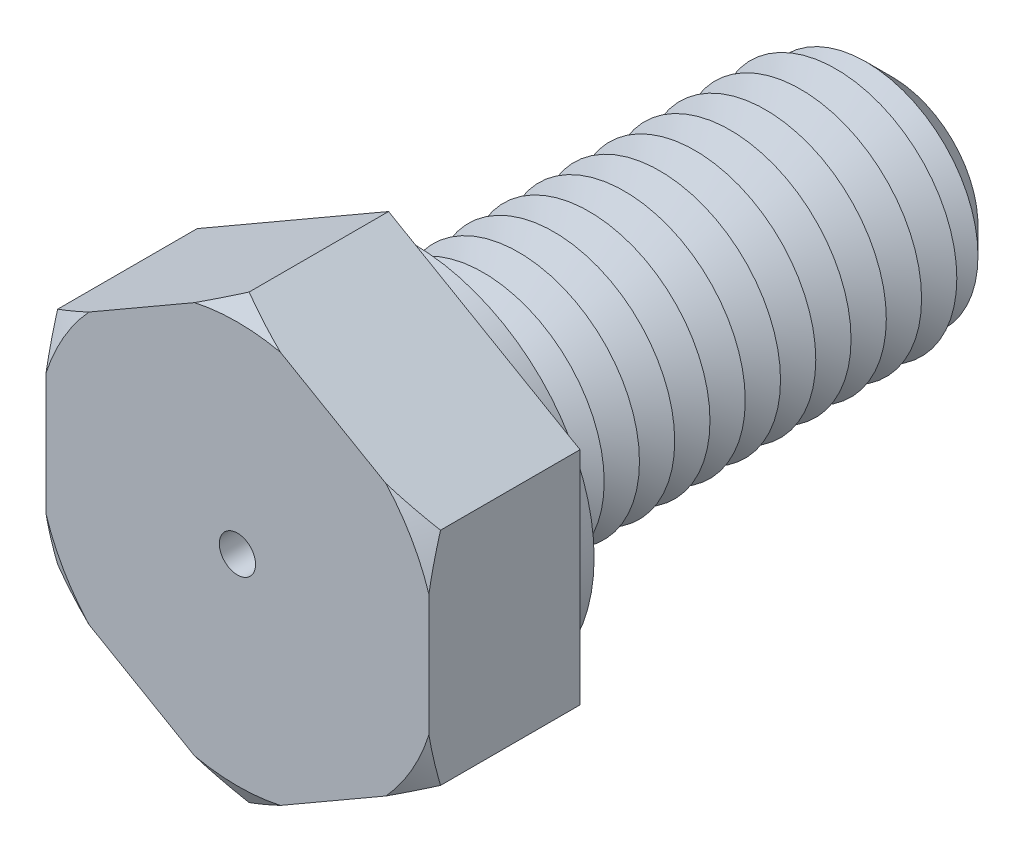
ISO-10303-21;
HEADER;
FILE_DESCRIPTION(('STEP AP214'),'2;1');
FILE_NAME('part.step','',(''),(''),'','','');
FILE_SCHEMA(('AUTOMOTIVE_DESIGN { 1 0 10303 214 1 1 1 1 }'));
ENDSEC;
DATA;
#1=APPLICATION_CONTEXT('core data for automotive mechanical design processes');
#2=APPLICATION_PROTOCOL_DEFINITION('international standard','automotive_design',2000,#1);
#3=PRODUCT_CONTEXT('',#1,'mechanical');
#4=PRODUCT('Part','Part','',(#3));
#5=PRODUCT_RELATED_PRODUCT_CATEGORY('part','',(#4));
#6=PRODUCT_DEFINITION_FORMATION('','',#4);
#7=PRODUCT_DEFINITION_CONTEXT('part definition',#1,'design');
#8=PRODUCT_DEFINITION('design','',#6,#7);
#9=PRODUCT_DEFINITION_SHAPE('','',#8);
#10=(LENGTH_UNIT() NAMED_UNIT(*) SI_UNIT(.MILLI.,.METRE.));
#11=(NAMED_UNIT(*) PLANE_ANGLE_UNIT() SI_UNIT($,.RADIAN.));
#12=(NAMED_UNIT(*) SI_UNIT($,.STERADIAN.) SOLID_ANGLE_UNIT());
#13=UNCERTAINTY_MEASURE_WITH_UNIT(LENGTH_MEASURE(1.E-05),#10,'distance_accuracy_value','');
#14=(GEOMETRIC_REPRESENTATION_CONTEXT(3) GLOBAL_UNCERTAINTY_ASSIGNED_CONTEXT((#13)) GLOBAL_UNIT_ASSIGNED_CONTEXT((#10,
#11,#12)) REPRESENTATION_CONTEXT('',''));
#15=CARTESIAN_POINT('',(0.,0.,0.));
#16=DIRECTION('',(0.,0.,1.));
#17=DIRECTION('',(1.,0.,0.));
#18=AXIS2_PLACEMENT_3D('',#15,#16,#17);
#19=CARTESIAN_POINT('',(9.5,5.48482755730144,7.5));
#20=DIRECTION('',(-0.5,-0.866025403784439,0.));
#21=DIRECTION('',(0.866025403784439,-0.5,0.));
#22=AXIS2_PLACEMENT_3D('',#19,#20,#21);
#23=PLANE('',#22);
#24=CARTESIAN_POINT('',(16.0911028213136,1.67945256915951,3.91531658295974));
#25=CARTESIAN_POINT('',(15.7926530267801,1.85176263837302,4.07633378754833));
#26=CARTESIAN_POINT('',(15.4934885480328,2.02448533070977,4.23561185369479));
#27=CARTESIAN_POINT('',(14.8934288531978,2.37092995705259,4.54987291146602));
#28=CARTESIAN_POINT('',(14.5925334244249,2.54465201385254,4.70485536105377));
#29=CARTESIAN_POINT('',(13.9878148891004,2.89378642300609,5.01015744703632));
#30=CARTESIAN_POINT('',(13.6839854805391,3.06920241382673,5.16046049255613));
#31=CARTESIAN_POINT('',(13.0740489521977,3.4213494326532,5.45475890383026));
#32=CARTESIAN_POINT('',(12.7679419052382,3.59808041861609,5.59875447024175));
#33=CARTESIAN_POINT('',(12.1452865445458,3.95757065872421,5.88261207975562));
#34=CARTESIAN_POINT('',(11.8286703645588,4.14036909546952,6.02227655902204));
#35=CARTESIAN_POINT('',(11.1922429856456,4.50781061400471,6.29164435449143));
#36=CARTESIAN_POINT('',(10.8724316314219,4.69245378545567,6.42134718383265));
#37=CARTESIAN_POINT('',(10.2295404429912,5.06362718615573,6.66831982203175));
#38=CARTESIAN_POINT('',(9.90646410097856,5.25015539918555,6.78560163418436));
#39=CARTESIAN_POINT('',(9.2565183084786,5.62540177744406,7.00502233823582));
#40=CARTESIAN_POINT('',(8.92964935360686,5.81411965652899,7.1071631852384));
#41=CARTESIAN_POINT('',(8.14786487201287,6.26548313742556,7.32807954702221));
#42=CARTESIAN_POINT('',(7.6911273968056,6.52918064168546,7.43861218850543));
#43=CARTESIAN_POINT('',(7.00135730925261,6.92741958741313,7.57140056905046));
#44=CARTESIAN_POINT('',(6.77066782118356,7.06060822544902,7.61016053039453));
#45=CARTESIAN_POINT('',(6.30799755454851,7.3277310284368,7.6757081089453));
#46=CARTESIAN_POINT('',(6.07601678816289,7.46166518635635,7.70249583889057));
#47=CARTESIAN_POINT('',(5.61390562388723,7.72846519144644,7.74308971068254));
#48=CARTESIAN_POINT('',(5.38378495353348,7.86132542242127,7.75704275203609));
#49=CARTESIAN_POINT('',(4.92322735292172,8.1272284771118,7.77208284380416));
#50=CARTESIAN_POINT('',(4.69279042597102,8.26027129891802,7.7731700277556));
#51=CARTESIAN_POINT('',(4.23214422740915,8.52622550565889,7.76244373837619));
#52=CARTESIAN_POINT('',(4.00193495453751,8.65913689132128,7.7506303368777));
#53=CARTESIAN_POINT('',(3.54223236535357,8.92454630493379,7.71446028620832));
#54=CARTESIAN_POINT('',(3.31273916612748,9.05704426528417,7.69010168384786));
#55=CARTESIAN_POINT('',(2.77042202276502,9.37015121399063,7.61833387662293));
#56=CARTESIAN_POINT('',(2.45810922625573,9.55046509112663,7.56573497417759));
#57=CARTESIAN_POINT('',(1.83647686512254,9.90936470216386,7.44074774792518));
#58=CARTESIAN_POINT('',(1.52715774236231,10.087950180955,7.36835654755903));
#59=CARTESIAN_POINT('',(0.911549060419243,10.4433720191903,7.20651778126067));
#60=CARTESIAN_POINT('',(0.605263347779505,10.6202061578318,7.1170509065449));
#61=CARTESIAN_POINT('',(-0.00386858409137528,10.9718886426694,6.92387899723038));
#62=CARTESIAN_POINT('',(-0.30671501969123,11.1467371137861,6.8201748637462));
#63=CARTESIAN_POINT('',(-0.912759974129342,11.496637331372,6.59968787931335));
#64=CARTESIAN_POINT('',(-1.21591973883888,11.6716667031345,6.48276398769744));
#65=CARTESIAN_POINT('',(-1.8190277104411,12.0198712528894,6.23911056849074));
#66=CARTESIAN_POINT('',(-2.11897790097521,12.1930475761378,6.11238754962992));
#67=CARTESIAN_POINT('',(-2.71614501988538,12.5378221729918,5.85087494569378));
#68=CARTESIAN_POINT('',(-3.01336251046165,12.7094207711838,5.71608706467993));
#69=CARTESIAN_POINT('',(-3.60546807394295,13.0512730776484,5.43985672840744));
#70=CARTESIAN_POINT('',(-3.90035610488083,13.2215267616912,5.29841415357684));
#71=CARTESIAN_POINT('',(-4.39671248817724,13.5080982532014,5.05486951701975));
#72=CARTESIAN_POINT('',(-4.59871463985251,13.624724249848,4.95421186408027));
#73=CARTESIAN_POINT('',(-5.00183994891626,13.8574687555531,4.75059724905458));
#74=CARTESIAN_POINT('',(-5.20296313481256,13.9735872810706,4.647640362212));
#75=CARTESIAN_POINT('',(-5.60231741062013,14.2041545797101,4.44078592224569));
#76=CARTESIAN_POINT('',(-5.80055672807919,14.3186081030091,4.33690951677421));
#77=CARTESIAN_POINT('',(-6.19633679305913,14.5471118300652,4.12738601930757));
#78=CARTESIAN_POINT('',(-6.39387752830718,14.6611620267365,4.02173889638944));
#79=CARTESIAN_POINT('',(-6.59110282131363,14.7750301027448,3.91531658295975));
#80=B_SPLINE_CURVE_WITH_KNOTS('',3,(#24,#25,#26,#27,#28,#29,#30,#31,#32,#33,#34,#35,#36,#37,#38,
#39,#40,#41,#42,#43,#44,#45,#46,#47,#48,#49,#50,#51,#52,#53,#54,#55,#56,#57,#58,#59,#60,#61,#62,
#63,#64,#65,#66,#67,#68,#69,#70,#71,#72,#73,#74,#75,#76,#77,#78,#79),.UNSPECIFIED.,.F.,.F.,(4,2,
2,2,2,2,2,2,2,2,2,2,2,2,2,2,2,2,2,2,2,2,2,2,2,2,2,4),(0.,1.14115474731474,2.28245284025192,
3.42741980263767,4.57235031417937,5.74632926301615,6.92036555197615,8.09325673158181,
9.26599632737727,10.8807998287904,11.6881240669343,12.4954407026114,13.2933978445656,
14.0913467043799,14.8892911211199,15.6873598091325,16.7800286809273,17.8728564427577,
18.9669273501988,20.0609290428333,21.1679585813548,22.2742590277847,23.380326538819,
24.4864139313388,25.2485345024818,26.010630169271,26.7647435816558,27.5188701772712),.UNSPECIFIED.);
#81=CARTESIAN_POINT('',(9.5,5.48482755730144,6.92264973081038));
#82=VERTEX_POINT('',#81);
#83=CARTESIAN_POINT('',(7.36878164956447,6.71528704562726,7.5));
#84=VERTEX_POINT('',#83);
#85=EDGE_CURVE('E132',#82,#84,#80,.T.);
#86=ORIENTED_EDGE('',*,*,#85,.F.);
#87=DIRECTION('',(0.,0.,-1.));
#88=VECTOR('',#87,1.);
#89=CARTESIAN_POINT('',(9.5,5.48482755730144,7.5));
#90=LINE('',#89,#88);
#91=CARTESIAN_POINT('',(9.5,5.48482755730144,0.));
#92=VERTEX_POINT('',#91);
#93=EDGE_CURVE('E144',#82,#92,#90,.T.);
#94=ORIENTED_EDGE('',*,*,#93,.T.);
#95=DIRECTION('',(-0.866025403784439,0.5,0.));
#96=VECTOR('',#95,1.);
#97=CARTESIAN_POINT('',(9.5,5.48482755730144,0.));
#98=LINE('',#97,#96);
#99=CARTESIAN_POINT('',(0.,10.9696551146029,0.));
#100=VERTEX_POINT('',#99);
#101=EDGE_CURVE('E305',#92,#100,#98,.T.);
#102=ORIENTED_EDGE('',*,*,#101,.T.);
#103=DIRECTION('',(0.,0.,-1.));
#104=VECTOR('',#103,1.);
#105=CARTESIAN_POINT('',(0.,10.9696551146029,7.5));
#106=LINE('',#105,#104);
#107=CARTESIAN_POINT('',(0.,10.9696551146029,6.92264973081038));
#108=VERTEX_POINT('',#107);
#109=EDGE_CURVE('E179',#108,#100,#106,.T.);
#110=ORIENTED_EDGE('',*,*,#109,.F.);
#111=CARTESIAN_POINT('',(2.13121835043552,9.73919562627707,7.5));
#112=VERTEX_POINT('',#111);
#113=EDGE_CURVE('E151',#112,#108,#80,.T.);
#114=ORIENTED_EDGE('',*,*,#113,.F.);
#115=DIRECTION('',(-0.866025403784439,0.5,0.));
#116=VECTOR('',#115,1.);
#117=CARTESIAN_POINT('',(9.5,5.48482755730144,7.5));
#118=LINE('',#117,#116);
#119=EDGE_CURVE('E148',#84,#112,#118,.T.);
#120=ORIENTED_EDGE('',*,*,#119,.F.);
#121=EDGE_LOOP('',(#86,#94,#102,#110,#114,#120));
#122=FACE_BOUND('',#121,.T.);
#123=ADVANCED_FACE('F39',(#122),#23,.F.);
#124=CARTESIAN_POINT('',(0.,10.9696551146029,7.5));
#125=DIRECTION('',(0.5,-0.866025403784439,0.));
#126=DIRECTION('',(0.866025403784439,0.5,0.));
#127=AXIS2_PLACEMENT_3D('',#124,#125,#126);
#128=PLANE('',#127);
#129=CARTESIAN_POINT('',(6.59110282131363,14.7750301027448,3.91531658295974));
#130=CARTESIAN_POINT('',(6.29265302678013,14.6027200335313,4.07633378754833));
#131=CARTESIAN_POINT('',(5.99348854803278,14.4299973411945,4.23561185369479));
#132=CARTESIAN_POINT('',(5.3934288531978,14.0835527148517,4.54987291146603));
#133=CARTESIAN_POINT('',(5.09253342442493,13.9098306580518,4.70485536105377));
#134=CARTESIAN_POINT('',(4.48781488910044,13.5606962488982,5.01015744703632));
#135=CARTESIAN_POINT('',(4.18398548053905,13.3852802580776,5.16046049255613));
#136=CARTESIAN_POINT('',(3.5740489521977,13.0331332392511,5.45475890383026));
#137=CARTESIAN_POINT('',(3.26794190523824,12.8564022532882,5.59875447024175));
#138=CARTESIAN_POINT('',(2.64528654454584,12.4969120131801,5.88261207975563));
#139=CARTESIAN_POINT('',(2.32867036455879,12.3141135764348,6.02227655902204));
#140=CARTESIAN_POINT('',(1.69224298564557,11.9466720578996,6.29164435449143));
#141=CARTESIAN_POINT('',(1.37243163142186,11.7620288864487,6.42134718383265));
#142=CARTESIAN_POINT('',(0.729540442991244,11.3908554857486,6.66831982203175));
#143=CARTESIAN_POINT('',(0.406464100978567,11.2043272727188,6.78560163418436));
#144=CARTESIAN_POINT('',(-0.243481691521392,10.8290808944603,7.00502233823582));
#145=CARTESIAN_POINT('',(-0.570350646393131,10.6403630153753,7.1071631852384));
#146=CARTESIAN_POINT('',(-1.35213512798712,10.1889995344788,7.32807954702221));
#147=CARTESIAN_POINT('',(-1.80887260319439,9.92530203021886,7.43861218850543));
#148=CARTESIAN_POINT('',(-2.49864269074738,9.52706308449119,7.57140056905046));
#149=CARTESIAN_POINT('',(-2.72933217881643,9.39387444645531,7.61016053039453));
#150=CARTESIAN_POINT('',(-3.19200244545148,9.12675164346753,7.6757081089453));
#151=CARTESIAN_POINT('',(-3.4239832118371,8.99281748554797,7.70249583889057));
#152=CARTESIAN_POINT('',(-3.88609437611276,8.72601748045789,7.74308971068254));
#153=CARTESIAN_POINT('',(-4.11621504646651,8.59315724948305,7.75704275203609));
#154=CARTESIAN_POINT('',(-4.57677264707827,8.32725419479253,7.77208284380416));
#155=CARTESIAN_POINT('',(-4.80720957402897,8.19421137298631,7.7731700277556));
#156=CARTESIAN_POINT('',(-5.26785577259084,7.92825716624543,7.76244373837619));
#157=CARTESIAN_POINT('',(-5.49806504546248,7.79534578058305,7.7506303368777));
#158=CARTESIAN_POINT('',(-5.95776763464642,7.52993636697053,7.71446028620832));
#159=CARTESIAN_POINT('',(-6.18726083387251,7.39743840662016,7.69010168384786));
#160=CARTESIAN_POINT('',(-6.72957797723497,7.0843314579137,7.61833387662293));
#161=CARTESIAN_POINT('',(-7.04189077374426,6.90401758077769,7.56573497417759));
#162=CARTESIAN_POINT('',(-7.66352313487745,6.54511796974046,7.44074774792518));
#163=CARTESIAN_POINT('',(-7.97284225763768,6.36653249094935,7.36835654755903));
#164=CARTESIAN_POINT('',(-8.58845093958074,6.01111065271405,7.20651778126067));
#165=CARTESIAN_POINT('',(-8.89473665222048,5.83427651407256,7.1170509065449));
#166=CARTESIAN_POINT('',(-9.50386858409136,5.48259402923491,6.92387899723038));
#167=CARTESIAN_POINT('',(-9.80671501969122,5.30774555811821,6.8201748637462));
#168=CARTESIAN_POINT('',(-10.4127599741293,4.95784534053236,6.59968787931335));
#169=CARTESIAN_POINT('',(-10.7159197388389,4.78281596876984,6.48276398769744));
#170=CARTESIAN_POINT('',(-11.3190277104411,4.43461141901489,6.23911056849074));
#171=CARTESIAN_POINT('',(-11.6189779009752,4.26143509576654,6.11238754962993));
#172=CARTESIAN_POINT('',(-12.2161450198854,3.91666049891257,5.85087494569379));
#173=CARTESIAN_POINT('',(-12.5133625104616,3.74506190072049,5.71608706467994));
#174=CARTESIAN_POINT('',(-13.1054680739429,3.40320959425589,5.43985672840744));
#175=CARTESIAN_POINT('',(-13.4003561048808,3.2329559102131,5.29841415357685));
#176=CARTESIAN_POINT('',(-13.8967124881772,2.94638441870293,5.05486951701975));
#177=CARTESIAN_POINT('',(-14.0987146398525,2.82975842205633,4.95421186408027));
#178=CARTESIAN_POINT('',(-14.5018399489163,2.59701391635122,4.75059724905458));
#179=CARTESIAN_POINT('',(-14.7029631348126,2.48089539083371,4.647640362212));
#180=CARTESIAN_POINT('',(-15.1023174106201,2.25032809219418,4.44078592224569));
#181=CARTESIAN_POINT('',(-15.3005567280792,2.13587456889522,4.33690951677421));
#182=CARTESIAN_POINT('',(-15.6963367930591,1.90737084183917,4.12738601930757));
#183=CARTESIAN_POINT('',(-15.8938775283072,1.79332064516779,4.02173889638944));
#184=CARTESIAN_POINT('',(-16.0911028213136,1.67945256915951,3.91531658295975));
#185=B_SPLINE_CURVE_WITH_KNOTS('',3,(#129,#130,#131,#132,#133,#134,#135,#136,#137,#138,#139,
#140,#141,#142,#143,#144,#145,#146,#147,#148,#149,#150,#151,#152,#153,#154,#155,#156,#157,#158,
#159,#160,#161,#162,#163,#164,#165,#166,#167,#168,#169,#170,#171,#172,#173,#174,#175,#176,#177,
#178,#179,#180,#181,#182,#183,#184),.UNSPECIFIED.,.F.,.F.,(4,2,2,2,2,2,2,2,2,2,2,2,2,2,2,2,2,2,
2,2,2,2,2,2,2,2,2,4),(0.,1.14115474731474,2.28245284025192,3.42741980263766,4.57235031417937,
5.74632926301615,6.92036555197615,8.09325673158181,9.26599632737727,10.8807998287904,
11.6881240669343,12.4954407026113,13.2933978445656,14.0913467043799,14.8892911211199,
15.6873598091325,16.7800286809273,17.8728564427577,18.9669273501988,20.0609290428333,
21.1679585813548,22.2742590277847,23.380326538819,24.4864139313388,25.2485345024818,
26.010630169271,26.7647435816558,27.5188701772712),.UNSPECIFIED.);
#186=CARTESIAN_POINT('',(-2.13121835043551,9.73919562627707,7.5));
#187=VERTEX_POINT('',#186);
#188=EDGE_CURVE('E358',#108,#187,#185,.T.);
#189=ORIENTED_EDGE('',*,*,#188,.F.);
#190=ORIENTED_EDGE('',*,*,#109,.T.);
#191=DIRECTION('',(-0.866025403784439,-0.5,0.));
#192=VECTOR('',#191,1.);
#193=CARTESIAN_POINT('',(0.,10.9696551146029,0.));
#194=LINE('',#193,#192);
#195=CARTESIAN_POINT('',(-9.5,5.48482755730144,0.));
#196=VERTEX_POINT('',#195);
#197=EDGE_CURVE('E324',#100,#196,#194,.T.);
#198=ORIENTED_EDGE('',*,*,#197,.T.);
#199=DIRECTION('',(0.,0.,-1.));
#200=VECTOR('',#199,1.);
#201=CARTESIAN_POINT('',(-9.5,5.48482755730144,7.5));
#202=LINE('',#201,#200);
#203=CARTESIAN_POINT('',(-9.5,5.48482755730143,6.92264973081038));
#204=VERTEX_POINT('',#203);
#205=EDGE_CURVE('E176',#204,#196,#202,.T.);
#206=ORIENTED_EDGE('',*,*,#205,.F.);
#207=CARTESIAN_POINT('',(-7.36878164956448,6.71528704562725,7.5));
#208=VERTEX_POINT('',#207);
#209=EDGE_CURVE('E371',#208,#204,#185,.T.);
#210=ORIENTED_EDGE('',*,*,#209,.F.);
#211=DIRECTION('',(-0.866025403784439,-0.5,0.));
#212=VECTOR('',#211,1.);
#213=CARTESIAN_POINT('',(0.,10.9696551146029,7.5));
#214=LINE('',#213,#212);
#215=EDGE_CURVE('E307',#187,#208,#214,.T.);
#216=ORIENTED_EDGE('',*,*,#215,.F.);
#217=EDGE_LOOP('',(#189,#190,#198,#206,#210,#216));
#218=FACE_BOUND('',#217,.T.);
#219=ADVANCED_FACE('F384',(#218),#128,.F.);
#220=CARTESIAN_POINT('',(-9.5,5.48482755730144,7.5));
#221=DIRECTION('',(1.,0.,0.));
#222=DIRECTION('',(0.,1.,0.));
#223=AXIS2_PLACEMENT_3D('',#220,#221,#222);
#224=PLANE('',#223);
#225=CARTESIAN_POINT('',(-9.5,12.0759303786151,4.38509256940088));
#226=CARTESIAN_POINT('',(-9.5,11.7327439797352,4.5407773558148));
#227=CARTESIAN_POINT('',(-9.5,11.388618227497,4.69443095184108));
#228=CARTESIAN_POINT('',(-9.5,10.698085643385,4.99669009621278));
#229=CARTESIAN_POINT('',(-9.5,10.3516784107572,5.1452947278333));
#230=CARTESIAN_POINT('',(-9.5,9.65484997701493,5.43702212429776));
#231=CARTESIAN_POINT('',(-9.5,9.30441804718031,5.58011936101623));
#232=CARTESIAN_POINT('',(-9.5,8.60059023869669,5.85880989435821));
#233=CARTESIAN_POINT('',(-9.5,8.24719449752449,5.9944035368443));
#234=CARTESIAN_POINT('',(-9.5,7.53860340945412,6.25582574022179));
#235=CARTESIAN_POINT('',(-9.5,7.18342337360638,6.38169559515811));
#236=CARTESIAN_POINT('',(-9.5,6.46926569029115,6.62229858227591));
#237=CARTESIAN_POINT('',(-9.5,6.11028785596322,6.73703116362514));
#238=CARTESIAN_POINT('',(-9.5,5.38872372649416,6.95272419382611));
#239=CARTESIAN_POINT('',(-9.5,5.02614305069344,7.05370330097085));
#240=CARTESIAN_POINT('',(-9.5,4.29675196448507,7.23920160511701));
#241=CARTESIAN_POINT('',(-9.5,3.92994173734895,7.32372151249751));
#242=CARTESIAN_POINT('',(-9.5,3.29665308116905,7.45205940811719));
#243=CARTESIAN_POINT('',(-9.5,3.03113701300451,7.50062833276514));
#244=CARTESIAN_POINT('',(-9.5,2.49832809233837,7.5865841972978));
#245=CARTESIAN_POINT('',(-9.5,2.23103554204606,7.62397299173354));
#246=CARTESIAN_POINT('',(-9.5,1.69506861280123,7.68659004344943));
#247=CARTESIAN_POINT('',(-9.5,1.42639449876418,7.71182055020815));
#248=CARTESIAN_POINT('',(-9.5,0.888138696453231,7.74939803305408));
#249=CARTESIAN_POINT('',(-9.5,0.618557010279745,7.76174503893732));
#250=CARTESIAN_POINT('',(-9.5,0.0792458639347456,7.77317034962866));
#251=CARTESIAN_POINT('',(-9.5,-0.190483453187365,7.77225534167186));
#252=CARTESIAN_POINT('',(-9.5,-0.729567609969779,7.75720205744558));
#253=CARTESIAN_POINT('',(-9.5,-0.998922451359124,7.74306384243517));
#254=CARTESIAN_POINT('',(-9.5,-1.53667618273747,7.70199575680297));
#255=CARTESIAN_POINT('',(-9.5,-1.80507496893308,7.67506453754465));
#256=CARTESIAN_POINT('',(-9.5,-2.34038611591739,7.60918517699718));
#257=CARTESIAN_POINT('',(-9.5,-2.60729841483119,7.57023653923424));
#258=CARTESIAN_POINT('',(-9.5,-3.27166409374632,7.45918941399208));
#259=CARTESIAN_POINT('',(-9.5,-3.66797754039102,7.38023980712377));
#260=CARTESIAN_POINT('',(-9.5,-4.45585575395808,7.20141943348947));
#261=CARTESIAN_POINT('',(-9.5,-4.8474194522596,7.10154404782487));
#262=CARTESIAN_POINT('',(-9.5,-5.6265713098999,6.88438943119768));
#263=CARTESIAN_POINT('',(-9.5,-6.01414884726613,6.76707245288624));
#264=CARTESIAN_POINT('',(-9.5,-6.78474185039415,6.51851091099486));
#265=CARTESIAN_POINT('',(-9.5,-7.16775763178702,6.38726731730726));
#266=CARTESIAN_POINT('',(-9.5,-7.93407213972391,6.11202298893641));
#267=CARTESIAN_POINT('',(-9.5,-8.31732458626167,5.96789419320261));
#268=CARTESIAN_POINT('',(-9.5,-9.08024927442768,5.67043108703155));
#269=CARTESIAN_POINT('',(-9.5,-9.4599212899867,5.51709619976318));
#270=CARTESIAN_POINT('',(-9.5,-10.2138362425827,5.20397874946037));
#271=CARTESIAN_POINT('',(-9.5,-10.5880982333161,5.04424191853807));
#272=CARTESIAN_POINT('',(-9.5,-11.1474871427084,4.80018423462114));
#273=CARTESIAN_POINT('',(-9.5,-11.3335947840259,4.71809930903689));
#274=CARTESIAN_POINT('',(-9.5,-11.7052038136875,4.55257683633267));
#275=CARTESIAN_POINT('',(-9.5,-11.8907052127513,4.46913931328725));
#276=CARTESIAN_POINT('',(-9.5,-12.0759303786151,4.38509256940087));
#277=B_SPLINE_CURVE_WITH_KNOTS('',3,(#225,#226,#227,#228,#229,#230,#231,#232,#233,#234,#235,
#236,#237,#238,#239,#240,#241,#242,#243,#244,#245,#246,#247,#248,#249,#250,#251,#252,#253,#254,
#255,#256,#257,#258,#259,#260,#261,#262,#263,#264,#265,#266,#267,#268,#269,#270,#271,#272,#273,
#274,#275,#276),.UNSPECIFIED.,.F.,.F.,(4,2,2,2,2,2,2,2,2,2,2,2,2,2,2,2,2,2,2,2,2,2,2,2,2,4),(0.,
1.13056270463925,2.26132959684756,3.39682602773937,4.53227007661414,5.66259174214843,
6.79296928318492,7.92179771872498,9.0505774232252,9.86013572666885,10.6695596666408,
11.4788337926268,12.288106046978,13.0969702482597,13.9058307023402,14.7147764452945,
15.5237556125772,16.7353316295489,17.9471753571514,19.1616810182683,20.3761021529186,
21.6043286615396,22.8326322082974,24.0533405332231,24.6635541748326,25.273756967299),.UNSPECIFIED.);
#278=CARTESIAN_POINT('',(-9.5,3.02390858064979,7.5));
#279=VERTEX_POINT('',#278);
#280=EDGE_CURVE('E361',#204,#279,#277,.T.);
#281=ORIENTED_EDGE('',*,*,#280,.F.);
#282=ORIENTED_EDGE('',*,*,#205,.T.);
#283=DIRECTION('',(0.,-1.,0.));
#284=VECTOR('',#283,1.);
#285=CARTESIAN_POINT('',(-9.5,5.48482755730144,0.));
#286=LINE('',#285,#284);
#287=CARTESIAN_POINT('',(-9.5,-5.48482755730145,0.));
#288=VERTEX_POINT('',#287);
#289=EDGE_CURVE('E328',#196,#288,#286,.T.);
#290=ORIENTED_EDGE('',*,*,#289,.T.);
#291=DIRECTION('',(0.,0.,-1.));
#292=VECTOR('',#291,1.);
#293=CARTESIAN_POINT('',(-9.5,-5.48482755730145,7.5));
#294=LINE('',#293,#292);
#295=CARTESIAN_POINT('',(-9.49999999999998,-5.48482755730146,6.92264973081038));
#296=VERTEX_POINT('',#295);
#297=EDGE_CURVE('E173',#296,#288,#294,.T.);
#298=ORIENTED_EDGE('',*,*,#297,.F.);
#299=CARTESIAN_POINT('',(-9.5,-3.02390858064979,7.5));
#300=VERTEX_POINT('',#299);
#301=EDGE_CURVE('E347',#300,#296,#277,.T.);
#302=ORIENTED_EDGE('',*,*,#301,.F.);
#303=DIRECTION('',(0.,-1.,0.));
#304=VECTOR('',#303,1.);
#305=CARTESIAN_POINT('',(-9.5,5.48482755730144,7.5));
#306=LINE('',#305,#304);
#307=EDGE_CURVE('E311',#279,#300,#306,.T.);
#308=ORIENTED_EDGE('',*,*,#307,.F.);
#309=EDGE_LOOP('',(#281,#282,#290,#298,#302,#308));
#310=FACE_BOUND('',#309,.T.);
#311=ADVANCED_FACE('F420',(#310),#224,.F.);
#312=CARTESIAN_POINT('',(-9.5,-5.48482755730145,7.5));
#313=DIRECTION('',(0.5,0.866025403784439,0.));
#314=DIRECTION('',(-0.866025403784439,0.5,0.));
#315=AXIS2_PLACEMENT_3D('',#312,#313,#314);
#316=PLANE('',#315);
#317=CARTESIAN_POINT('',(-16.0911028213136,-1.67945256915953,3.91531658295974));
#318=CARTESIAN_POINT('',(-15.7926530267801,-1.85176263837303,4.07633378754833));
#319=CARTESIAN_POINT('',(-15.4934885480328,-2.02448533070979,4.23561185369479));
#320=CARTESIAN_POINT('',(-14.8934288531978,-2.37092995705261,4.54987291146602));
#321=CARTESIAN_POINT('',(-14.5925334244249,-2.54465201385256,4.70485536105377));
#322=CARTESIAN_POINT('',(-13.9878148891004,-2.89378642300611,5.01015744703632));
#323=CARTESIAN_POINT('',(-13.683985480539,-3.06920241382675,5.16046049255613));
#324=CARTESIAN_POINT('',(-13.0740489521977,-3.42134943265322,5.45475890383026));
#325=CARTESIAN_POINT('',(-12.7679419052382,-3.5980804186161,5.59875447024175));
#326=CARTESIAN_POINT('',(-12.1452865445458,-3.95757065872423,5.88261207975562));
#327=CARTESIAN_POINT('',(-11.8286703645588,-4.14036909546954,6.02227655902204));
#328=CARTESIAN_POINT('',(-11.1922429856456,-4.50781061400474,6.29164435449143));
#329=CARTESIAN_POINT('',(-10.8724316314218,-4.69245378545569,6.42134718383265));
#330=CARTESIAN_POINT('',(-10.2295404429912,-5.06362718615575,6.66831982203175));
#331=CARTESIAN_POINT('',(-9.90646410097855,-5.25015539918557,6.78560163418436));
#332=CARTESIAN_POINT('',(-9.25651830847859,-5.62540177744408,7.00502233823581));
#333=CARTESIAN_POINT('',(-8.92964935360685,-5.81411965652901,7.1071631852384));
#334=CARTESIAN_POINT('',(-8.14786487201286,-6.26548313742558,7.32807954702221));
#335=CARTESIAN_POINT('',(-7.69112739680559,-6.52918064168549,7.43861218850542));
#336=CARTESIAN_POINT('',(-7.0013573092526,-6.92741958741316,7.57140056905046));
#337=CARTESIAN_POINT('',(-6.77066782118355,-7.06060822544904,7.61016053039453));
#338=CARTESIAN_POINT('',(-6.3079975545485,-7.32773102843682,7.6757081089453));
#339=CARTESIAN_POINT('',(-6.07601678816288,-7.46166518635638,7.70249583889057));
#340=CARTESIAN_POINT('',(-5.61390562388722,-7.72846519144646,7.74308971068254));
#341=CARTESIAN_POINT('',(-5.38378495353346,-7.8613254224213,7.75704275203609));
#342=CARTESIAN_POINT('',(-4.9232273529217,-8.12722847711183,7.77208284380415));
#343=CARTESIAN_POINT('',(-4.692790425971,-8.26027129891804,7.77317002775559));
#344=CARTESIAN_POINT('',(-4.23214422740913,-8.52622550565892,7.76244373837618));
#345=CARTESIAN_POINT('',(-4.00193495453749,-8.6591368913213,7.75063033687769));
#346=CARTESIAN_POINT('',(-3.54223236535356,-8.92454630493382,7.71446028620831));
#347=CARTESIAN_POINT('',(-3.31273916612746,-9.05704426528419,7.69010168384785));
#348=CARTESIAN_POINT('',(-2.770422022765,-9.37015121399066,7.61833387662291));
#349=CARTESIAN_POINT('',(-2.45810922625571,-9.55046509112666,7.56573497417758));
#350=CARTESIAN_POINT('',(-1.83647686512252,-9.9093647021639,7.44074774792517));
#351=CARTESIAN_POINT('',(-1.52715774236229,-10.087950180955,7.36835654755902));
#352=CARTESIAN_POINT('',(-0.911549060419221,-10.4433720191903,7.20651778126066));
#353=CARTESIAN_POINT('',(-0.605263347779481,-10.6202061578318,7.11705090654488));
#354=CARTESIAN_POINT('',(0.00386858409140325,-10.9718886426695,6.92387899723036));
#355=CARTESIAN_POINT('',(0.30671501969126,-11.1467371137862,6.82017486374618));
#356=CARTESIAN_POINT('',(0.912759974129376,-11.496637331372,6.59968787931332));
#357=CARTESIAN_POINT('',(1.21591973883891,-11.6716667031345,6.48276398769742));
#358=CARTESIAN_POINT('',(1.81902771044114,-12.0198712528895,6.23911056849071));
#359=CARTESIAN_POINT('',(2.11897790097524,-12.1930475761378,6.11238754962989));
#360=CARTESIAN_POINT('',(2.71614501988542,-12.5378221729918,5.85087494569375));
#361=CARTESIAN_POINT('',(3.01336251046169,-12.7094207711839,5.7160870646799));
#362=CARTESIAN_POINT('',(3.60546807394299,-13.0512730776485,5.4398567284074));
#363=CARTESIAN_POINT('',(3.90035610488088,-13.2215267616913,5.29841415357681));
#364=CARTESIAN_POINT('',(4.39671248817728,-13.5080982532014,5.05486951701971));
#365=CARTESIAN_POINT('',(4.59871463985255,-13.624724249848,4.95421186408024));
#366=CARTESIAN_POINT('',(5.00183994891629,-13.8574687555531,4.75059724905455));
#367=CARTESIAN_POINT('',(5.20296313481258,-13.9735872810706,4.64764036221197));
#368=CARTESIAN_POINT('',(5.60231741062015,-14.2041545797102,4.44078592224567));
#369=CARTESIAN_POINT('',(5.8005567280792,-14.3186081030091,4.33690951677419));
#370=CARTESIAN_POINT('',(6.19633679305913,-14.5471118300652,4.12738601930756));
#371=CARTESIAN_POINT('',(6.39387752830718,-14.6611620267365,4.02173889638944));
#372=CARTESIAN_POINT('',(6.59110282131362,-14.7750301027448,3.91531658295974));
#373=B_SPLINE_CURVE_WITH_KNOTS('',3,(#317,#318,#319,#320,#321,#322,#323,#324,#325,#326,#327,
#328,#329,#330,#331,#332,#333,#334,#335,#336,#337,#338,#339,#340,#341,#342,#343,#344,#345,#346,
#347,#348,#349,#350,#351,#352,#353,#354,#355,#356,#357,#358,#359,#360,#361,#362,#363,#364,#365,
#366,#367,#368,#369,#370,#371,#372),.UNSPECIFIED.,.F.,.F.,(4,2,2,2,2,2,2,2,2,2,2,2,2,2,2,2,2,2,
2,2,2,2,2,2,2,2,2,4),(0.,1.14115474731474,2.28245284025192,3.42741980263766,4.57235031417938,
5.74632926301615,6.92036555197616,8.09325673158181,9.26599632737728,10.8807998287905,
11.6881240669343,12.4954407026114,13.2933978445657,14.0913467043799,14.8892911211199,
15.6873598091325,16.7800286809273,17.8728564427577,18.9669273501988,20.0609290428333,
21.1679585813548,22.2742590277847,23.3803265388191,24.4864139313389,25.2485345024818,
26.010630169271,26.7647435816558,27.5188701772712),.UNSPECIFIED.);
#374=CARTESIAN_POINT('',(-7.36878164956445,-6.71528704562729,7.5));
#375=VERTEX_POINT('',#374);
#376=EDGE_CURVE('E346',#296,#375,#373,.T.);
#377=ORIENTED_EDGE('',*,*,#376,.F.);
#378=ORIENTED_EDGE('',*,*,#297,.T.);
#379=DIRECTION('',(0.866025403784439,-0.5,0.));
#380=VECTOR('',#379,1.);
#381=CARTESIAN_POINT('',(-9.5,-5.48482755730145,0.));
#382=LINE('',#381,#380);
#383=CARTESIAN_POINT('',(0.,-10.9696551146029,0.));
#384=VERTEX_POINT('',#383);
#385=EDGE_CURVE('E332',#288,#384,#382,.T.);
#386=ORIENTED_EDGE('',*,*,#385,.T.);
#387=DIRECTION('',(0.,0.,-1.));
#388=VECTOR('',#387,1.);
#389=CARTESIAN_POINT('',(0.,-10.9696551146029,7.5));
#390=LINE('',#389,#388);
#391=CARTESIAN_POINT('',(0.,-10.9696551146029,6.92264973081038));
#392=VERTEX_POINT('',#391);
#393=EDGE_CURVE('E163',#392,#384,#390,.T.);
#394=ORIENTED_EDGE('',*,*,#393,.F.);
#395=CARTESIAN_POINT('',(-2.13121835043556,-9.73919562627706,7.5));
#396=VERTEX_POINT('',#395);
#397=EDGE_CURVE('E348',#396,#392,#373,.T.);
#398=ORIENTED_EDGE('',*,*,#397,.F.);
#399=DIRECTION('',(0.866025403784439,-0.5,0.));
#400=VECTOR('',#399,1.);
#401=CARTESIAN_POINT('',(-9.5,-5.48482755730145,7.5));
#402=LINE('',#401,#400);
#403=EDGE_CURVE('E315',#375,#396,#402,.T.);
#404=ORIENTED_EDGE('',*,*,#403,.F.);
#405=EDGE_LOOP('',(#377,#378,#386,#394,#398,#404));
#406=FACE_BOUND('',#405,.T.);
#407=ADVANCED_FACE('F416',(#406),#316,.F.);
#408=CARTESIAN_POINT('',(0.,-10.9696551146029,7.5));
#409=DIRECTION('',(-0.5,0.866025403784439,0.));
#410=DIRECTION('',(-0.866025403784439,-0.5,0.));
#411=AXIS2_PLACEMENT_3D('',#408,#409,#410);
#412=PLANE('',#411);
#413=CARTESIAN_POINT('',(-6.59110282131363,-14.7750301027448,3.91531658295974));
#414=CARTESIAN_POINT('',(-6.29265302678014,-14.6027200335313,4.07633378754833));
#415=CARTESIAN_POINT('',(-5.99348854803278,-14.4299973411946,4.23561185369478));
#416=CARTESIAN_POINT('',(-5.3934288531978,-14.0835527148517,4.54987291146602));
#417=CARTESIAN_POINT('',(-5.09253342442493,-13.9098306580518,4.70485536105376));
#418=CARTESIAN_POINT('',(-4.48781488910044,-13.5606962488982,5.01015744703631));
#419=CARTESIAN_POINT('',(-4.18398548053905,-13.3852802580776,5.16046049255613));
#420=CARTESIAN_POINT('',(-3.5740489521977,-13.0331332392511,5.45475890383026));
#421=CARTESIAN_POINT('',(-3.26794190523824,-12.8564022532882,5.59875447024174));
#422=CARTESIAN_POINT('',(-2.64528654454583,-12.4969120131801,5.88261207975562));
#423=CARTESIAN_POINT('',(-2.32867036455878,-12.3141135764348,6.02227655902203));
#424=CARTESIAN_POINT('',(-1.69224298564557,-11.9466720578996,6.29164435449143));
#425=CARTESIAN_POINT('',(-1.37243163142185,-11.7620288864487,6.42134718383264));
#426=CARTESIAN_POINT('',(-0.729540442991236,-11.3908554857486,6.66831982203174));
#427=CARTESIAN_POINT('',(-0.406464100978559,-11.2043272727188,6.78560163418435));
#428=CARTESIAN_POINT('',(0.243481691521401,-10.8290808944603,7.00502233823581));
#429=CARTESIAN_POINT('',(0.570350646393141,-10.6403630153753,7.10716318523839));
#430=CARTESIAN_POINT('',(1.35213512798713,-10.1889995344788,7.3280795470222));
#431=CARTESIAN_POINT('',(1.8088726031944,-9.92530203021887,7.43861218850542));
#432=CARTESIAN_POINT('',(2.49864269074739,-9.5270630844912,7.57140056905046));
#433=CARTESIAN_POINT('',(2.72933217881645,-9.39387444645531,7.61016053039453));
#434=CARTESIAN_POINT('',(3.19200244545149,-9.12675164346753,7.6757081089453));
#435=CARTESIAN_POINT('',(3.42398321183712,-8.99281748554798,7.70249583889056));
#436=CARTESIAN_POINT('',(3.88609437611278,-8.72601748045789,7.74308971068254));
#437=CARTESIAN_POINT('',(4.11621504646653,-8.59315724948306,7.75704275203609));
#438=CARTESIAN_POINT('',(4.57677264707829,-8.32725419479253,7.77208284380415));
#439=CARTESIAN_POINT('',(4.80720957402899,-8.19421137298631,7.77317002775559));
#440=CARTESIAN_POINT('',(5.26785577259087,-7.92825716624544,7.76244373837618));
#441=CARTESIAN_POINT('',(5.4980650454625,-7.79534578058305,7.75063033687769));
#442=CARTESIAN_POINT('',(5.95776763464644,-7.52993636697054,7.71446028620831));
#443=CARTESIAN_POINT('',(6.18726083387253,-7.39743840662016,7.69010168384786));
#444=CARTESIAN_POINT('',(6.72957797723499,-7.0843314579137,7.61833387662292));
#445=CARTESIAN_POINT('',(7.04189077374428,-6.9040175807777,7.56573497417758));
#446=CARTESIAN_POINT('',(7.66352313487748,-6.54511796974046,7.44074774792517));
#447=CARTESIAN_POINT('',(7.97284225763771,-6.36653249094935,7.36835654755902));
#448=CARTESIAN_POINT('',(8.58845093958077,-6.01111065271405,7.20651778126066));
#449=CARTESIAN_POINT('',(8.89473665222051,-5.83427651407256,7.11705090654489));
#450=CARTESIAN_POINT('',(9.50386858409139,-5.48259402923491,6.92387899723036));
#451=CARTESIAN_POINT('',(9.80671501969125,-5.30774555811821,6.82017486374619));
#452=CARTESIAN_POINT('',(10.4127599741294,-4.95784534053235,6.59968787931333));
#453=CARTESIAN_POINT('',(10.7159197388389,-4.78281596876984,6.48276398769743));
#454=CARTESIAN_POINT('',(11.3190277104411,-4.43461141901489,6.23911056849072));
#455=CARTESIAN_POINT('',(11.6189779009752,-4.26143509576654,6.1123875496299));
#456=CARTESIAN_POINT('',(12.2161450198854,-3.91666049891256,5.85087494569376));
#457=CARTESIAN_POINT('',(12.5133625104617,-3.74506190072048,5.71608706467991));
#458=CARTESIAN_POINT('',(13.105468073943,-3.40320959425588,5.43985672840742));
#459=CARTESIAN_POINT('',(13.4003561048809,-3.23295591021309,5.29841415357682));
#460=CARTESIAN_POINT('',(13.8967124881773,-2.94638441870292,5.05486951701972));
#461=CARTESIAN_POINT('',(14.0987146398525,-2.82975842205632,4.95421186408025));
#462=CARTESIAN_POINT('',(14.5018399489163,-2.59701391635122,4.75059724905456));
#463=CARTESIAN_POINT('',(14.7029631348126,-2.48089539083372,4.64764036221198));
#464=CARTESIAN_POINT('',(15.1023174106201,-2.25032809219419,4.44078592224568));
#465=CARTESIAN_POINT('',(15.3005567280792,-2.13587456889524,4.3369095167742));
#466=CARTESIAN_POINT('',(15.6963367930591,-1.90737084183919,4.12738601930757));
#467=CARTESIAN_POINT('',(15.8938775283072,-1.79332064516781,4.02173889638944));
#468=CARTESIAN_POINT('',(16.0911028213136,-1.67945256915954,3.91531658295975));
#469=B_SPLINE_CURVE_WITH_KNOTS('',3,(#413,#414,#415,#416,#417,#418,#419,#420,#421,#422,#423,
#424,#425,#426,#427,#428,#429,#430,#431,#432,#433,#434,#435,#436,#437,#438,#439,#440,#441,#442,
#443,#444,#445,#446,#447,#448,#449,#450,#451,#452,#453,#454,#455,#456,#457,#458,#459,#460,#461,
#462,#463,#464,#465,#466,#467,#468),.UNSPECIFIED.,.F.,.F.,(4,2,2,2,2,2,2,2,2,2,2,2,2,2,2,2,2,2,
2,2,2,2,2,2,2,2,2,4),(0.,1.14115474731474,2.28245284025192,3.42741980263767,4.57235031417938,
5.74632926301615,6.92036555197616,8.09325673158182,9.26599632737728,10.8807998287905,
11.6881240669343,12.4954407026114,13.2933978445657,14.0913467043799,14.8892911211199,
15.6873598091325,16.7800286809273,17.8728564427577,18.9669273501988,20.0609290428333,
21.1679585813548,22.2742590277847,23.3803265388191,24.4864139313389,25.2485345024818,
26.010630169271,26.7647435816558,27.5188701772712),.UNSPECIFIED.);
#470=CARTESIAN_POINT('',(2.13121835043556,-9.73919562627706,7.5));
#471=VERTEX_POINT('',#470);
#472=EDGE_CURVE('E64',#392,#471,#469,.T.);
#473=ORIENTED_EDGE('',*,*,#472,.F.);
#474=ORIENTED_EDGE('',*,*,#393,.T.);
#475=DIRECTION('',(0.866025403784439,0.5,0.));
#476=VECTOR('',#475,1.);
#477=CARTESIAN_POINT('',(0.,-10.9696551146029,0.));
#478=LINE('',#477,#476);
#479=CARTESIAN_POINT('',(9.5,-5.48482755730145,0.));
#480=VERTEX_POINT('',#479);
#481=EDGE_CURVE('E335',#384,#480,#478,.T.);
#482=ORIENTED_EDGE('',*,*,#481,.T.);
#483=DIRECTION('',(0.,0.,-1.));
#484=VECTOR('',#483,1.);
#485=CARTESIAN_POINT('',(9.5,-5.48482755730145,7.5));
#486=LINE('',#485,#484);
#487=CARTESIAN_POINT('',(9.5,-5.48482755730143,6.92264973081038));
#488=VERTEX_POINT('',#487);
#489=EDGE_CURVE('E157',#488,#480,#486,.T.);
#490=ORIENTED_EDGE('',*,*,#489,.F.);
#491=CARTESIAN_POINT('',(7.36878164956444,-6.71528704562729,7.5));
#492=VERTEX_POINT('',#491);
#493=EDGE_CURVE('E369',#492,#488,#469,.T.);
#494=ORIENTED_EDGE('',*,*,#493,.F.);
#495=DIRECTION('',(0.866025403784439,0.5,0.));
#496=VECTOR('',#495,1.);
#497=CARTESIAN_POINT('',(0.,-10.9696551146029,7.5));
#498=LINE('',#497,#496);
#499=EDGE_CURVE('E166',#471,#492,#498,.T.);
#500=ORIENTED_EDGE('',*,*,#499,.F.);
#501=EDGE_LOOP('',(#473,#474,#482,#490,#494,#500));
#502=FACE_BOUND('',#501,.T.);
#503=ADVANCED_FACE('F419',(#502),#412,.F.);
#504=CARTESIAN_POINT('',(9.5,-5.48482755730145,7.5));
#505=DIRECTION('',(-1.,0.,0.));
#506=DIRECTION('',(0.,-1.,0.));
#507=AXIS2_PLACEMENT_3D('',#504,#505,#506);
#508=PLANE('',#507);
#509=CARTESIAN_POINT('',(9.5,-12.0759303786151,4.38509256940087));
#510=CARTESIAN_POINT('',(9.5,-11.7327439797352,4.54077735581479));
#511=CARTESIAN_POINT('',(9.5,-11.388618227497,4.69443095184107));
#512=CARTESIAN_POINT('',(9.5,-10.698085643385,4.99669009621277));
#513=CARTESIAN_POINT('',(9.5,-10.3516784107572,5.14529472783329));
#514=CARTESIAN_POINT('',(9.5,-9.65484997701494,5.43702212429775));
#515=CARTESIAN_POINT('',(9.5,-9.30441804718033,5.58011936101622));
#516=CARTESIAN_POINT('',(9.5,-8.60059023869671,5.8588098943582));
#517=CARTESIAN_POINT('',(9.5,-8.2471944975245,5.99440353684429));
#518=CARTESIAN_POINT('',(9.5,-7.53860340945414,6.25582574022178));
#519=CARTESIAN_POINT('',(9.5,-7.18342337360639,6.3816955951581));
#520=CARTESIAN_POINT('',(9.5,-6.46926569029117,6.6222985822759));
#521=CARTESIAN_POINT('',(9.5,-6.11028785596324,6.73703116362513));
#522=CARTESIAN_POINT('',(9.5,-5.38872372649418,6.95272419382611));
#523=CARTESIAN_POINT('',(9.5,-5.02614305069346,7.05370330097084));
#524=CARTESIAN_POINT('',(9.5,-4.29675196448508,7.239201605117));
#525=CARTESIAN_POINT('',(9.5,-3.92994173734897,7.32372151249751));
#526=CARTESIAN_POINT('',(9.5,-3.29665308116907,7.45205940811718));
#527=CARTESIAN_POINT('',(9.5,-3.03113701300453,7.50062833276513));
#528=CARTESIAN_POINT('',(9.5,-2.49832809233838,7.5865841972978));
#529=CARTESIAN_POINT('',(9.5,-2.23103554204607,7.62397299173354));
#530=CARTESIAN_POINT('',(9.5,-1.69506861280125,7.68659004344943));
#531=CARTESIAN_POINT('',(9.5,-1.4263944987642,7.71182055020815));
#532=CARTESIAN_POINT('',(9.5,-0.888138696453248,7.74939803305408));
#533=CARTESIAN_POINT('',(9.5,-0.618557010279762,7.76174503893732));
#534=CARTESIAN_POINT('',(9.5,-0.0792458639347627,7.77317034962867));
#535=CARTESIAN_POINT('',(9.5,0.190483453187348,7.77225534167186));
#536=CARTESIAN_POINT('',(9.5,0.729567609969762,7.75720205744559));
#537=CARTESIAN_POINT('',(9.5,0.998922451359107,7.74306384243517));
#538=CARTESIAN_POINT('',(9.5,1.53667618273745,7.70199575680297));
#539=CARTESIAN_POINT('',(9.5,1.80507496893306,7.67506453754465));
#540=CARTESIAN_POINT('',(9.5,2.34038611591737,7.60918517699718));
#541=CARTESIAN_POINT('',(9.5,2.60729841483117,7.57023653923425));
#542=CARTESIAN_POINT('',(9.5,3.2716640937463,7.45918941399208));
#543=CARTESIAN_POINT('',(9.5,3.667977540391,7.38023980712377));
#544=CARTESIAN_POINT('',(9.5,4.45585575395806,7.20141943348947));
#545=CARTESIAN_POINT('',(9.5,4.84741945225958,7.10154404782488));
#546=CARTESIAN_POINT('',(9.5,5.62657130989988,6.88438943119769));
#547=CARTESIAN_POINT('',(9.5,6.01414884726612,6.76707245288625));
#548=CARTESIAN_POINT('',(9.5,6.78474185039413,6.51851091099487));
#549=CARTESIAN_POINT('',(9.5,7.167757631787,6.38726731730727));
#550=CARTESIAN_POINT('',(9.5,7.93407213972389,6.11202298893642));
#551=CARTESIAN_POINT('',(9.5,8.31732458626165,5.96789419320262));
#552=CARTESIAN_POINT('',(9.5,9.08024927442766,5.67043108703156));
#553=CARTESIAN_POINT('',(9.5,9.45992128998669,5.51709619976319));
#554=CARTESIAN_POINT('',(9.5,10.2138362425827,5.20397874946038));
#555=CARTESIAN_POINT('',(9.5,10.5880982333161,5.04424191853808));
#556=CARTESIAN_POINT('',(9.5,11.1474871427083,4.80018423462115));
#557=CARTESIAN_POINT('',(9.5,11.3335947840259,4.7180993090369));
#558=CARTESIAN_POINT('',(9.5,11.7052038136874,4.55257683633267));
#559=CARTESIAN_POINT('',(9.5,11.8907052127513,4.46913931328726));
#560=CARTESIAN_POINT('',(9.5,12.0759303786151,4.38509256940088));
#561=B_SPLINE_CURVE_WITH_KNOTS('',3,(#509,#510,#511,#512,#513,#514,#515,#516,#517,#518,#519,
#520,#521,#522,#523,#524,#525,#526,#527,#528,#529,#530,#531,#532,#533,#534,#535,#536,#537,#538,
#539,#540,#541,#542,#543,#544,#545,#546,#547,#548,#549,#550,#551,#552,#553,#554,#555,#556,#557,
#558,#559,#560),.UNSPECIFIED.,.F.,.F.,(4,2,2,2,2,2,2,2,2,2,2,2,2,2,2,2,2,2,2,2,2,2,2,2,2,4),(0.,
1.13056270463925,2.26132959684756,3.39682602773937,4.53227007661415,5.66259174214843,
6.79296928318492,7.92179771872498,9.0505774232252,9.86013572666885,10.6695596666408,
11.4788337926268,12.288106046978,13.0969702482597,13.9058307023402,14.7147764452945,
15.5237556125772,16.7353316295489,17.9471753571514,19.1616810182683,20.3761021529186,
21.6043286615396,22.8326322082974,24.0533405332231,24.6635541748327,25.273756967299),.UNSPECIFIED.);
#562=CARTESIAN_POINT('',(9.5,-3.0239085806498,7.5));
#563=VERTEX_POINT('',#562);
#564=EDGE_CURVE('E56',#488,#563,#561,.T.);
#565=ORIENTED_EDGE('',*,*,#564,.F.);
#566=ORIENTED_EDGE('',*,*,#489,.T.);
#567=DIRECTION('',(0.,1.,0.));
#568=VECTOR('',#567,1.);
#569=CARTESIAN_POINT('',(9.5,-5.48482755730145,0.));
#570=LINE('',#569,#568);
#571=EDGE_CURVE('E154',#480,#92,#570,.T.);
#572=ORIENTED_EDGE('',*,*,#571,.T.);
#573=ORIENTED_EDGE('',*,*,#93,.F.);
#574=CARTESIAN_POINT('',(9.5,3.0239085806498,7.5));
#575=VERTEX_POINT('',#574);
#576=EDGE_CURVE('E129',#575,#82,#561,.T.);
#577=ORIENTED_EDGE('',*,*,#576,.F.);
#578=DIRECTION('',(0.,1.,0.));
#579=VECTOR('',#578,1.);
#580=CARTESIAN_POINT('',(9.5,-5.48482755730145,7.5));
#581=LINE('',#580,#579);
#582=EDGE_CURVE('E158',#563,#575,#581,.T.);
#583=ORIENTED_EDGE('',*,*,#582,.F.);
#584=EDGE_LOOP('',(#565,#566,#572,#573,#577,#583));
#585=FACE_BOUND('',#584,.T.);
#586=ADVANCED_FACE('F152',(#585),#508,.F.);
#587=CARTESIAN_POINT('',(0.,0.,7.5));
#588=DIRECTION('',(0.,0.,1.));
#589=DIRECTION('',(1.,0.,0.));
#590=AXIS2_PLACEMENT_3D('',#587,#588,#589);
#591=PLANE('',#590);
#592=CARTESIAN_POINT('',(0.,0.,7.5));
#593=DIRECTION('',(0.,0.,1.));
#594=DIRECTION('',(1.,0.,0.));
#595=AXIS2_PLACEMENT_3D('',#592,#593,#594);
#596=CIRCLE('',#595,0.9);
#597=CARTESIAN_POINT('',(0.9,0.,7.5));
#598=VERTEX_POINT('',#597);
#599=EDGE_CURVE('E343',#598,#598,#596,.T.);
#600=ORIENTED_EDGE('',*,*,#599,.F.);
#601=EDGE_LOOP('',(#600));
#602=FACE_BOUND('',#601,.T.);
#603=ORIENTED_EDGE('',*,*,#582,.T.);
#604=CARTESIAN_POINT('',(0.,0.,7.5));
#605=DIRECTION('',(0.,0.,1.));
#606=DIRECTION('',(1.,0.,0.));
#607=AXIS2_PLACEMENT_3D('',#604,#605,#606);
#608=CIRCLE('',#607,9.96965511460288);
#609=EDGE_CURVE('E134',#575,#84,#608,.T.);
#610=ORIENTED_EDGE('',*,*,#609,.T.);
#611=ORIENTED_EDGE('',*,*,#119,.T.);
#612=CARTESIAN_POINT('',(0.,0.,7.5));
#613=DIRECTION('',(0.,0.,1.));
#614=DIRECTION('',(1.,0.,0.));
#615=AXIS2_PLACEMENT_3D('',#612,#613,#614);
#616=CIRCLE('',#615,9.96965511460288);
#617=EDGE_CURVE('E11',#112,#187,#616,.T.);
#618=ORIENTED_EDGE('',*,*,#617,.T.);
#619=ORIENTED_EDGE('',*,*,#215,.T.);
#620=EDGE_CURVE('E49',#208,#279,#616,.T.);
#621=ORIENTED_EDGE('',*,*,#620,.T.);
#622=ORIENTED_EDGE('',*,*,#307,.T.);
#623=EDGE_CURVE('E354',#300,#375,#616,.T.);
#624=ORIENTED_EDGE('',*,*,#623,.T.);
#625=ORIENTED_EDGE('',*,*,#403,.T.);
#626=EDGE_CURVE('E356',#396,#471,#616,.T.);
#627=ORIENTED_EDGE('',*,*,#626,.T.);
#628=ORIENTED_EDGE('',*,*,#499,.T.);
#629=EDGE_CURVE('E43',#492,#563,#616,.T.);
#630=ORIENTED_EDGE('',*,*,#629,.T.);
#631=EDGE_LOOP('',(#603,#610,#611,#618,#619,#621,#622,#624,#625,#627,#628,#630));
#632=FACE_BOUND('',#631,.T.);
#633=ADVANCED_FACE('F459',(#602,#632),#591,.T.);
#634=CARTESIAN_POINT('',(0.,0.,0.));
#635=DIRECTION('',(0.,0.,1.));
#636=DIRECTION('',(1.,0.,0.));
#637=AXIS2_PLACEMENT_3D('',#634,#635,#636);
#638=PLANE('',#637);
#639=CARTESIAN_POINT('',(0.,0.,0.));
#640=DIRECTION('',(0.,0.,1.));
#641=DIRECTION('',(1.,0.,0.));
#642=AXIS2_PLACEMENT_3D('',#639,#640,#641);
#643=CIRCLE('',#642,9.);
#644=CARTESIAN_POINT('',(9.,0.,0.));
#645=VERTEX_POINT('',#644);
#646=EDGE_CURVE('E181',#645,#645,#643,.F.);
#647=ORIENTED_EDGE('',*,*,#646,.F.);
#648=EDGE_LOOP('',(#647));
#649=FACE_BOUND('',#648,.T.);
#650=ORIENTED_EDGE('',*,*,#101,.F.);
#651=ORIENTED_EDGE('',*,*,#571,.F.);
#652=ORIENTED_EDGE('',*,*,#481,.F.);
#653=ORIENTED_EDGE('',*,*,#385,.F.);
#654=ORIENTED_EDGE('',*,*,#289,.F.);
#655=ORIENTED_EDGE('',*,*,#197,.F.);
#656=EDGE_LOOP('',(#650,#651,#652,#653,#654,#655));
#657=FACE_BOUND('',#656,.T.);
#658=ADVANCED_FACE('F467',(#649,#657),#638,.F.);
#659=CARTESIAN_POINT('',(0.,0.,-1.2));
#660=DIRECTION('',(0.,0.,1.));
#661=DIRECTION('',(1.,0.,0.));
#662=AXIS2_PLACEMENT_3D('',#659,#660,#661);
#663=CYLINDRICAL_SURFACE('',#662,9.);
#664=CARTESIAN_POINT('',(0.,0.,-1.2));
#665=DIRECTION('',(0.,0.,-1.));
#666=DIRECTION('',(-1.,0.,0.));
#667=AXIS2_PLACEMENT_3D('',#664,#665,#666);
#668=CIRCLE('',#667,9.);
#669=CARTESIAN_POINT('',(-9.,0.,-1.2));
#670=VERTEX_POINT('',#669);
#671=EDGE_CURVE('E301',#670,#670,#668,.T.);
#672=ORIENTED_EDGE('',*,*,#671,.F.);
#673=EDGE_LOOP('',(#672));
#674=FACE_BOUND('',#673,.T.);
#675=ORIENTED_EDGE('',*,*,#646,.T.);
#676=EDGE_LOOP('',(#675));
#677=FACE_BOUND('',#676,.T.);
#678=ADVANCED_FACE('F478',(#674,#677),#663,.T.);
#679=CARTESIAN_POINT('',(0.,0.,-1.2));
#680=DIRECTION('',(0.,0.,-1.));
#681=DIRECTION('',(-1.,0.,0.));
#682=AXIS2_PLACEMENT_3D('',#679,#680,#681);
#683=PLANE('',#682);
#684=CARTESIAN_POINT('',(0.,0.,-1.2));
#685=DIRECTION('',(0.,0.,1.));
#686=DIRECTION('',(1.,0.,0.));
#687=AXIS2_PLACEMENT_3D('',#684,#685,#686);
#688=CIRCLE('',#687,6.);
#689=CARTESIAN_POINT('',(6.,0.,-1.2));
#690=VERTEX_POINT('',#689);
#691=EDGE_CURVE('E297',#690,#690,#688,.T.);
#692=ORIENTED_EDGE('',*,*,#691,.T.);
#693=EDGE_LOOP('',(#692));
#694=FACE_BOUND('',#693,.T.);
#695=ORIENTED_EDGE('',*,*,#671,.T.);
#696=EDGE_LOOP('',(#695));
#697=FACE_BOUND('',#696,.T.);
#698=ADVANCED_FACE('F487',(#694,#697),#683,.T.);
#699=CARTESIAN_POINT('',(0.,0.,-1.2));
#700=DIRECTION('',(0.,0.,1.));
#701=DIRECTION('',(1.,0.,0.));
#702=AXIS2_PLACEMENT_3D('',#699,#700,#701);
#703=CONICAL_SURFACE('',#702,6.,1.0471975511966);
#704=CARTESIAN_POINT('',(0.,0.,-2.075));
#705=DIRECTION('',(0.,0.,1.));
#706=DIRECTION('',(1.,0.,0.));
#707=AXIS2_PLACEMENT_3D('',#704,#705,#706);
#708=CIRCLE('',#707,4.48445554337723);
#709=CARTESIAN_POINT('',(4.48445554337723,0.,-2.075));
#710=VERTEX_POINT('',#709);
#711=EDGE_CURVE('E293',#710,#710,#708,.T.);
#712=ORIENTED_EDGE('',*,*,#711,.T.);
#713=EDGE_LOOP('',(#712));
#714=FACE_BOUND('',#713,.T.);
#715=ORIENTED_EDGE('',*,*,#691,.F.);
#716=EDGE_LOOP('',(#715));
#717=FACE_BOUND('',#716,.T.);
#718=ADVANCED_FACE('F496',(#714,#717),#703,.T.);
#719=CARTESIAN_POINT('',(0.,0.,-2.075));
#720=DIRECTION('',(0.,0.,-1.));
#721=DIRECTION('',(-1.,0.,0.));
#722=AXIS2_PLACEMENT_3D('',#719,#720,#721);
#723=CONICAL_SURFACE('',#722,4.48445554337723,1.0471975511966);
#724=CARTESIAN_POINT('',(0.,0.,-2.95));
#725=DIRECTION('',(0.,0.,1.));
#726=DIRECTION('',(1.,0.,0.));
#727=AXIS2_PLACEMENT_3D('',#724,#725,#726);
#728=CIRCLE('',#727,6.);
#729=CARTESIAN_POINT('',(6.,0.,-2.95));
#730=VERTEX_POINT('',#729);
#731=EDGE_CURVE('E289',#730,#730,#728,.T.);
#732=ORIENTED_EDGE('',*,*,#731,.T.);
#733=EDGE_LOOP('',(#732));
#734=FACE_BOUND('',#733,.T.);
#735=ORIENTED_EDGE('',*,*,#711,.F.);
#736=EDGE_LOOP('',(#735));
#737=FACE_BOUND('',#736,.T.);
#738=ADVANCED_FACE('F505',(#734,#737),#723,.T.);
#739=CARTESIAN_POINT('',(0.,0.,-2.95));
#740=DIRECTION('',(0.,0.,1.));
#741=DIRECTION('',(1.,0.,0.));
#742=AXIS2_PLACEMENT_3D('',#739,#740,#741);
#743=CONICAL_SURFACE('',#742,6.,1.0471975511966);
#744=CARTESIAN_POINT('',(0.,0.,-3.825));
#745=DIRECTION('',(0.,0.,1.));
#746=DIRECTION('',(1.,0.,0.));
#747=AXIS2_PLACEMENT_3D('',#744,#745,#746);
#748=CIRCLE('',#747,4.48445554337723);
#749=CARTESIAN_POINT('',(4.48445554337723,0.,-3.825));
#750=VERTEX_POINT('',#749);
#751=EDGE_CURVE('E285',#750,#750,#748,.T.);
#752=ORIENTED_EDGE('',*,*,#751,.T.);
#753=EDGE_LOOP('',(#752));
#754=FACE_BOUND('',#753,.T.);
#755=ORIENTED_EDGE('',*,*,#731,.F.);
#756=EDGE_LOOP('',(#755));
#757=FACE_BOUND('',#756,.T.);
#758=ADVANCED_FACE('F514',(#754,#757),#743,.T.);
#759=CARTESIAN_POINT('',(0.,0.,-3.825));
#760=DIRECTION('',(0.,0.,-1.));
#761=DIRECTION('',(-1.,0.,0.));
#762=AXIS2_PLACEMENT_3D('',#759,#760,#761);
#763=CONICAL_SURFACE('',#762,4.48445554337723,1.0471975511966);
#764=CARTESIAN_POINT('',(0.,0.,-4.7));
#765=DIRECTION('',(0.,0.,1.));
#766=DIRECTION('',(1.,0.,0.));
#767=AXIS2_PLACEMENT_3D('',#764,#765,#766);
#768=CIRCLE('',#767,6.);
#769=CARTESIAN_POINT('',(6.,0.,-4.7));
#770=VERTEX_POINT('',#769);
#771=EDGE_CURVE('E282',#770,#770,#768,.T.);
#772=ORIENTED_EDGE('',*,*,#771,.T.);
#773=EDGE_LOOP('',(#772));
#774=FACE_BOUND('',#773,.T.);
#775=ORIENTED_EDGE('',*,*,#751,.F.);
#776=EDGE_LOOP('',(#775));
#777=FACE_BOUND('',#776,.T.);
#778=ADVANCED_FACE('F523',(#774,#777),#763,.T.);
#779=CARTESIAN_POINT('',(0.,0.,-4.7));
#780=DIRECTION('',(0.,0.,1.));
#781=DIRECTION('',(1.,0.,0.));
#782=AXIS2_PLACEMENT_3D('',#779,#780,#781);
#783=CONICAL_SURFACE('',#782,6.,1.0471975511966);
#784=CARTESIAN_POINT('',(0.,0.,-5.575));
#785=DIRECTION('',(0.,0.,1.));
#786=DIRECTION('',(1.,0.,0.));
#787=AXIS2_PLACEMENT_3D('',#784,#785,#786);
#788=CIRCLE('',#787,4.48445554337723);
#789=CARTESIAN_POINT('',(4.48445554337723,0.,-5.575));
#790=VERTEX_POINT('',#789);
#791=EDGE_CURVE('E278',#790,#790,#788,.T.);
#792=ORIENTED_EDGE('',*,*,#791,.T.);
#793=EDGE_LOOP('',(#792));
#794=FACE_BOUND('',#793,.T.);
#795=ORIENTED_EDGE('',*,*,#771,.F.);
#796=EDGE_LOOP('',(#795));
#797=FACE_BOUND('',#796,.T.);
#798=ADVANCED_FACE('F532',(#794,#797),#783,.T.);
#799=CARTESIAN_POINT('',(0.,0.,-5.575));
#800=DIRECTION('',(0.,0.,-1.));
#801=DIRECTION('',(-1.,0.,0.));
#802=AXIS2_PLACEMENT_3D('',#799,#800,#801);
#803=CONICAL_SURFACE('',#802,4.48445554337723,1.0471975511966);
#804=CARTESIAN_POINT('',(0.,0.,-6.45));
#805=DIRECTION('',(0.,0.,1.));
#806=DIRECTION('',(1.,0.,0.));
#807=AXIS2_PLACEMENT_3D('',#804,#805,#806);
#808=CIRCLE('',#807,6.);
#809=CARTESIAN_POINT('',(6.,0.,-6.45));
#810=VERTEX_POINT('',#809);
#811=EDGE_CURVE('E274',#810,#810,#808,.T.);
#812=ORIENTED_EDGE('',*,*,#811,.T.);
#813=EDGE_LOOP('',(#812));
#814=FACE_BOUND('',#813,.T.);
#815=ORIENTED_EDGE('',*,*,#791,.F.);
#816=EDGE_LOOP('',(#815));
#817=FACE_BOUND('',#816,.T.);
#818=ADVANCED_FACE('F541',(#814,#817),#803,.T.);
#819=CARTESIAN_POINT('',(0.,0.,-6.45));
#820=DIRECTION('',(0.,0.,1.));
#821=DIRECTION('',(1.,0.,0.));
#822=AXIS2_PLACEMENT_3D('',#819,#820,#821);
#823=CONICAL_SURFACE('',#822,6.,1.0471975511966);
#824=CARTESIAN_POINT('',(0.,0.,-7.325));
#825=DIRECTION('',(0.,0.,1.));
#826=DIRECTION('',(1.,0.,0.));
#827=AXIS2_PLACEMENT_3D('',#824,#825,#826);
#828=CIRCLE('',#827,4.48445554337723);
#829=CARTESIAN_POINT('',(4.48445554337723,0.,-7.325));
#830=VERTEX_POINT('',#829);
#831=EDGE_CURVE('E271',#830,#830,#828,.T.);
#832=ORIENTED_EDGE('',*,*,#831,.T.);
#833=EDGE_LOOP('',(#832));
#834=FACE_BOUND('',#833,.T.);
#835=ORIENTED_EDGE('',*,*,#811,.F.);
#836=EDGE_LOOP('',(#835));
#837=FACE_BOUND('',#836,.T.);
#838=ADVANCED_FACE('F550',(#834,#837),#823,.T.);
#839=CARTESIAN_POINT('',(0.,0.,-7.325));
#840=DIRECTION('',(0.,0.,-1.));
#841=DIRECTION('',(-1.,0.,0.));
#842=AXIS2_PLACEMENT_3D('',#839,#840,#841);
#843=CONICAL_SURFACE('',#842,4.48445554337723,1.0471975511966);
#844=CARTESIAN_POINT('',(0.,0.,-8.2));
#845=DIRECTION('',(0.,0.,1.));
#846=DIRECTION('',(1.,0.,0.));
#847=AXIS2_PLACEMENT_3D('',#844,#845,#846);
#848=CIRCLE('',#847,6.);
#849=CARTESIAN_POINT('',(6.,0.,-8.2));
#850=VERTEX_POINT('',#849);
#851=EDGE_CURVE('E267',#850,#850,#848,.T.);
#852=ORIENTED_EDGE('',*,*,#851,.T.);
#853=EDGE_LOOP('',(#852));
#854=FACE_BOUND('',#853,.T.);
#855=ORIENTED_EDGE('',*,*,#831,.F.);
#856=EDGE_LOOP('',(#855));
#857=FACE_BOUND('',#856,.T.);
#858=ADVANCED_FACE('F559',(#854,#857),#843,.T.);
#859=CARTESIAN_POINT('',(0.,0.,-8.2));
#860=DIRECTION('',(0.,0.,1.));
#861=DIRECTION('',(1.,0.,0.));
#862=AXIS2_PLACEMENT_3D('',#859,#860,#861);
#863=CONICAL_SURFACE('',#862,6.,1.0471975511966);
#864=CARTESIAN_POINT('',(0.,0.,-9.075));
#865=DIRECTION('',(0.,0.,1.));
#866=DIRECTION('',(1.,0.,0.));
#867=AXIS2_PLACEMENT_3D('',#864,#865,#866);
#868=CIRCLE('',#867,4.48445554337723);
#869=CARTESIAN_POINT('',(4.48445554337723,0.,-9.075));
#870=VERTEX_POINT('',#869);
#871=EDGE_CURVE('E263',#870,#870,#868,.T.);
#872=ORIENTED_EDGE('',*,*,#871,.T.);
#873=EDGE_LOOP('',(#872));
#874=FACE_BOUND('',#873,.T.);
#875=ORIENTED_EDGE('',*,*,#851,.F.);
#876=EDGE_LOOP('',(#875));
#877=FACE_BOUND('',#876,.T.);
#878=ADVANCED_FACE('F568',(#874,#877),#863,.T.);
#879=CARTESIAN_POINT('',(0.,0.,-9.075));
#880=DIRECTION('',(0.,0.,-1.));
#881=DIRECTION('',(-1.,0.,0.));
#882=AXIS2_PLACEMENT_3D('',#879,#880,#881);
#883=CONICAL_SURFACE('',#882,4.48445554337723,1.0471975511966);
#884=CARTESIAN_POINT('',(0.,0.,-9.95));
#885=DIRECTION('',(0.,0.,1.));
#886=DIRECTION('',(1.,0.,0.));
#887=AXIS2_PLACEMENT_3D('',#884,#885,#886);
#888=CIRCLE('',#887,6.);
#889=CARTESIAN_POINT('',(6.,0.,-9.95));
#890=VERTEX_POINT('',#889);
#891=EDGE_CURVE('E259',#890,#890,#888,.T.);
#892=ORIENTED_EDGE('',*,*,#891,.T.);
#893=EDGE_LOOP('',(#892));
#894=FACE_BOUND('',#893,.T.);
#895=ORIENTED_EDGE('',*,*,#871,.F.);
#896=EDGE_LOOP('',(#895));
#897=FACE_BOUND('',#896,.T.);
#898=ADVANCED_FACE('F577',(#894,#897),#883,.T.);
#899=CARTESIAN_POINT('',(0.,0.,-9.95));
#900=DIRECTION('',(0.,0.,1.));
#901=DIRECTION('',(1.,0.,0.));
#902=AXIS2_PLACEMENT_3D('',#899,#900,#901);
#903=CONICAL_SURFACE('',#902,6.,1.0471975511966);
#904=CARTESIAN_POINT('',(0.,0.,-10.825));
#905=DIRECTION('',(0.,0.,1.));
#906=DIRECTION('',(1.,0.,0.));
#907=AXIS2_PLACEMENT_3D('',#904,#905,#906);
#908=CIRCLE('',#907,4.48445554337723);
#909=CARTESIAN_POINT('',(4.48445554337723,0.,-10.825));
#910=VERTEX_POINT('',#909);
#911=EDGE_CURVE('E255',#910,#910,#908,.T.);
#912=ORIENTED_EDGE('',*,*,#911,.T.);
#913=EDGE_LOOP('',(#912));
#914=FACE_BOUND('',#913,.T.);
#915=ORIENTED_EDGE('',*,*,#891,.F.);
#916=EDGE_LOOP('',(#915));
#917=FACE_BOUND('',#916,.T.);
#918=ADVANCED_FACE('F586',(#914,#917),#903,.T.);
#919=CARTESIAN_POINT('',(0.,0.,-10.825));
#920=DIRECTION('',(0.,0.,-1.));
#921=DIRECTION('',(-1.,0.,0.));
#922=AXIS2_PLACEMENT_3D('',#919,#920,#921);
#923=CONICAL_SURFACE('',#922,4.48445554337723,1.0471975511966);
#924=CARTESIAN_POINT('',(0.,0.,-11.7));
#925=DIRECTION('',(0.,0.,1.));
#926=DIRECTION('',(1.,0.,0.));
#927=AXIS2_PLACEMENT_3D('',#924,#925,#926);
#928=CIRCLE('',#927,6.);
#929=CARTESIAN_POINT('',(6.,0.,-11.7));
#930=VERTEX_POINT('',#929);
#931=EDGE_CURVE('E251',#930,#930,#928,.T.);
#932=ORIENTED_EDGE('',*,*,#931,.T.);
#933=EDGE_LOOP('',(#932));
#934=FACE_BOUND('',#933,.T.);
#935=ORIENTED_EDGE('',*,*,#911,.F.);
#936=EDGE_LOOP('',(#935));
#937=FACE_BOUND('',#936,.T.);
#938=ADVANCED_FACE('F595',(#934,#937),#923,.T.);
#939=CARTESIAN_POINT('',(0.,0.,-11.7));
#940=DIRECTION('',(0.,0.,1.));
#941=DIRECTION('',(1.,0.,0.));
#942=AXIS2_PLACEMENT_3D('',#939,#940,#941);
#943=CONICAL_SURFACE('',#942,6.,1.0471975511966);
#944=CARTESIAN_POINT('',(0.,0.,-12.575));
#945=DIRECTION('',(0.,0.,1.));
#946=DIRECTION('',(1.,0.,0.));
#947=AXIS2_PLACEMENT_3D('',#944,#945,#946);
#948=CIRCLE('',#947,4.48445554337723);
#949=CARTESIAN_POINT('',(4.48445554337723,0.,-12.575));
#950=VERTEX_POINT('',#949);
#951=EDGE_CURVE('E247',#950,#950,#948,.T.);
#952=ORIENTED_EDGE('',*,*,#951,.T.);
#953=EDGE_LOOP('',(#952));
#954=FACE_BOUND('',#953,.T.);
#955=ORIENTED_EDGE('',*,*,#931,.F.);
#956=EDGE_LOOP('',(#955));
#957=FACE_BOUND('',#956,.T.);
#958=ADVANCED_FACE('F604',(#954,#957),#943,.T.);
#959=CARTESIAN_POINT('',(0.,0.,-12.575));
#960=DIRECTION('',(0.,0.,-1.));
#961=DIRECTION('',(-1.,0.,0.));
#962=AXIS2_PLACEMENT_3D('',#959,#960,#961);
#963=CONICAL_SURFACE('',#962,4.48445554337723,1.0471975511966);
#964=CARTESIAN_POINT('',(0.,0.,-13.45));
#965=DIRECTION('',(0.,0.,1.));
#966=DIRECTION('',(1.,0.,0.));
#967=AXIS2_PLACEMENT_3D('',#964,#965,#966);
#968=CIRCLE('',#967,6.);
#969=CARTESIAN_POINT('',(6.,0.,-13.45));
#970=VERTEX_POINT('',#969);
#971=EDGE_CURVE('E243',#970,#970,#968,.T.);
#972=ORIENTED_EDGE('',*,*,#971,.T.);
#973=EDGE_LOOP('',(#972));
#974=FACE_BOUND('',#973,.T.);
#975=ORIENTED_EDGE('',*,*,#951,.F.);
#976=EDGE_LOOP('',(#975));
#977=FACE_BOUND('',#976,.T.);
#978=ADVANCED_FACE('F613',(#974,#977),#963,.T.);
#979=CARTESIAN_POINT('',(0.,0.,-13.45));
#980=DIRECTION('',(0.,0.,1.));
#981=DIRECTION('',(1.,0.,0.));
#982=AXIS2_PLACEMENT_3D('',#979,#980,#981);
#983=CONICAL_SURFACE('',#982,6.,1.0471975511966);
#984=CARTESIAN_POINT('',(0.,0.,-14.325));
#985=DIRECTION('',(0.,0.,1.));
#986=DIRECTION('',(1.,0.,0.));
#987=AXIS2_PLACEMENT_3D('',#984,#985,#986);
#988=CIRCLE('',#987,4.48445554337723);
#989=CARTESIAN_POINT('',(4.48445554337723,0.,-14.325));
#990=VERTEX_POINT('',#989);
#991=EDGE_CURVE('E239',#990,#990,#988,.T.);
#992=ORIENTED_EDGE('',*,*,#991,.T.);
#993=EDGE_LOOP('',(#992));
#994=FACE_BOUND('',#993,.T.);
#995=ORIENTED_EDGE('',*,*,#971,.F.);
#996=EDGE_LOOP('',(#995));
#997=FACE_BOUND('',#996,.T.);
#998=ADVANCED_FACE('F622',(#994,#997),#983,.T.);
#999=CARTESIAN_POINT('',(0.,0.,-14.325));
#1000=DIRECTION('',(0.,0.,-1.));
#1001=DIRECTION('',(-1.,0.,0.));
#1002=AXIS2_PLACEMENT_3D('',#999,#1000,#1001);
#1003=CONICAL_SURFACE('',#1002,4.48445554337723,1.0471975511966);
#1004=CARTESIAN_POINT('',(0.,0.,-15.2));
#1005=DIRECTION('',(0.,0.,1.));
#1006=DIRECTION('',(1.,0.,0.));
#1007=AXIS2_PLACEMENT_3D('',#1004,#1005,#1006);
#1008=CIRCLE('',#1007,6.);
#1009=CARTESIAN_POINT('',(6.,0.,-15.2));
#1010=VERTEX_POINT('',#1009);
#1011=EDGE_CURVE('E235',#1010,#1010,#1008,.T.);
#1012=ORIENTED_EDGE('',*,*,#1011,.T.);
#1013=EDGE_LOOP('',(#1012));
#1014=FACE_BOUND('',#1013,.T.);
#1015=ORIENTED_EDGE('',*,*,#991,.F.);
#1016=EDGE_LOOP('',(#1015));
#1017=FACE_BOUND('',#1016,.T.);
#1018=ADVANCED_FACE('F631',(#1014,#1017),#1003,.T.);
#1019=CARTESIAN_POINT('',(0.,0.,-15.2));
#1020=DIRECTION('',(0.,0.,1.));
#1021=DIRECTION('',(1.,0.,0.));
#1022=AXIS2_PLACEMENT_3D('',#1019,#1020,#1021);
#1023=CONICAL_SURFACE('',#1022,6.,1.0471975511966);
#1024=CARTESIAN_POINT('',(0.,0.,-16.075));
#1025=DIRECTION('',(0.,0.,1.));
#1026=DIRECTION('',(1.,0.,0.));
#1027=AXIS2_PLACEMENT_3D('',#1024,#1025,#1026);
#1028=CIRCLE('',#1027,4.48445554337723);
#1029=CARTESIAN_POINT('',(4.48445554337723,0.,-16.075));
#1030=VERTEX_POINT('',#1029);
#1031=EDGE_CURVE('E231',#1030,#1030,#1028,.T.);
#1032=ORIENTED_EDGE('',*,*,#1031,.T.);
#1033=EDGE_LOOP('',(#1032));
#1034=FACE_BOUND('',#1033,.T.);
#1035=ORIENTED_EDGE('',*,*,#1011,.F.);
#1036=EDGE_LOOP('',(#1035));
#1037=FACE_BOUND('',#1036,.T.);
#1038=ADVANCED_FACE('F640',(#1034,#1037),#1023,.T.);
#1039=CARTESIAN_POINT('',(0.,0.,-16.075));
#1040=DIRECTION('',(0.,0.,-1.));
#1041=DIRECTION('',(-1.,0.,0.));
#1042=AXIS2_PLACEMENT_3D('',#1039,#1040,#1041);
#1043=CONICAL_SURFACE('',#1042,4.48445554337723,1.0471975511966);
#1044=CARTESIAN_POINT('',(0.,0.,-16.95));
#1045=DIRECTION('',(0.,0.,1.));
#1046=DIRECTION('',(1.,0.,0.));
#1047=AXIS2_PLACEMENT_3D('',#1044,#1045,#1046);
#1048=CIRCLE('',#1047,6.);
#1049=CARTESIAN_POINT('',(6.,0.,-16.95));
#1050=VERTEX_POINT('',#1049);
#1051=EDGE_CURVE('E227',#1050,#1050,#1048,.T.);
#1052=ORIENTED_EDGE('',*,*,#1051,.T.);
#1053=EDGE_LOOP('',(#1052));
#1054=FACE_BOUND('',#1053,.T.);
#1055=ORIENTED_EDGE('',*,*,#1031,.F.);
#1056=EDGE_LOOP('',(#1055));
#1057=FACE_BOUND('',#1056,.T.);
#1058=ADVANCED_FACE('F649',(#1054,#1057),#1043,.T.);
#1059=CARTESIAN_POINT('',(0.,0.,-16.95));
#1060=DIRECTION('',(0.,0.,1.));
#1061=DIRECTION('',(1.,0.,0.));
#1062=AXIS2_PLACEMENT_3D('',#1059,#1060,#1061);
#1063=CONICAL_SURFACE('',#1062,6.,1.0471975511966);
#1064=CARTESIAN_POINT('',(0.,0.,-17.825));
#1065=DIRECTION('',(0.,0.,1.));
#1066=DIRECTION('',(1.,0.,0.));
#1067=AXIS2_PLACEMENT_3D('',#1064,#1065,#1066);
#1068=CIRCLE('',#1067,4.48445554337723);
#1069=CARTESIAN_POINT('',(4.48445554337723,0.,-17.825));
#1070=VERTEX_POINT('',#1069);
#1071=EDGE_CURVE('E223',#1070,#1070,#1068,.T.);
#1072=ORIENTED_EDGE('',*,*,#1071,.T.);
#1073=EDGE_LOOP('',(#1072));
#1074=FACE_BOUND('',#1073,.T.);
#1075=ORIENTED_EDGE('',*,*,#1051,.F.);
#1076=EDGE_LOOP('',(#1075));
#1077=FACE_BOUND('',#1076,.T.);
#1078=ADVANCED_FACE('F658',(#1074,#1077),#1063,.T.);
#1079=CARTESIAN_POINT('',(0.,0.,-17.825));
#1080=DIRECTION('',(0.,0.,-1.));
#1081=DIRECTION('',(-1.,0.,0.));
#1082=AXIS2_PLACEMENT_3D('',#1079,#1080,#1081);
#1083=CONICAL_SURFACE('',#1082,4.48445554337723,1.0471975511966);
#1084=CARTESIAN_POINT('',(0.,0.,-18.7));
#1085=DIRECTION('',(0.,0.,1.));
#1086=DIRECTION('',(1.,0.,0.));
#1087=AXIS2_PLACEMENT_3D('',#1084,#1085,#1086);
#1088=CIRCLE('',#1087,6.);
#1089=CARTESIAN_POINT('',(6.,0.,-18.7));
#1090=VERTEX_POINT('',#1089);
#1091=EDGE_CURVE('E219',#1090,#1090,#1088,.T.);
#1092=ORIENTED_EDGE('',*,*,#1091,.T.);
#1093=EDGE_LOOP('',(#1092));
#1094=FACE_BOUND('',#1093,.T.);
#1095=ORIENTED_EDGE('',*,*,#1071,.F.);
#1096=EDGE_LOOP('',(#1095));
#1097=FACE_BOUND('',#1096,.T.);
#1098=ADVANCED_FACE('F667',(#1094,#1097),#1083,.T.);
#1099=CARTESIAN_POINT('',(0.,0.,-18.7));
#1100=DIRECTION('',(0.,0.,1.));
#1101=DIRECTION('',(1.,0.,0.));
#1102=AXIS2_PLACEMENT_3D('',#1099,#1100,#1101);
#1103=CONICAL_SURFACE('',#1102,6.,1.0471975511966);
#1104=CARTESIAN_POINT('',(0.,0.,-19.575));
#1105=DIRECTION('',(0.,0.,1.));
#1106=DIRECTION('',(1.,0.,0.));
#1107=AXIS2_PLACEMENT_3D('',#1104,#1105,#1106);
#1108=CIRCLE('',#1107,4.48445554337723);
#1109=CARTESIAN_POINT('',(4.48445554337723,0.,-19.575));
#1110=VERTEX_POINT('',#1109);
#1111=EDGE_CURVE('E215',#1110,#1110,#1108,.T.);
#1112=ORIENTED_EDGE('',*,*,#1111,.T.);
#1113=EDGE_LOOP('',(#1112));
#1114=FACE_BOUND('',#1113,.T.);
#1115=ORIENTED_EDGE('',*,*,#1091,.F.);
#1116=EDGE_LOOP('',(#1115));
#1117=FACE_BOUND('',#1116,.T.);
#1118=ADVANCED_FACE('F676',(#1114,#1117),#1103,.T.);
#1119=CARTESIAN_POINT('',(0.,0.,-19.575));
#1120=DIRECTION('',(0.,0.,-1.));
#1121=DIRECTION('',(-1.,0.,0.));
#1122=AXIS2_PLACEMENT_3D('',#1119,#1120,#1121);
#1123=CONICAL_SURFACE('',#1122,4.48445554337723,1.0471975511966);
#1124=CARTESIAN_POINT('',(0.,0.,-20.45));
#1125=DIRECTION('',(0.,0.,1.));
#1126=DIRECTION('',(1.,0.,0.));
#1127=AXIS2_PLACEMENT_3D('',#1124,#1125,#1126);
#1128=CIRCLE('',#1127,6.);
#1129=CARTESIAN_POINT('',(6.,0.,-20.45));
#1130=VERTEX_POINT('',#1129);
#1131=EDGE_CURVE('E198',#1130,#1130,#1128,.T.);
#1132=ORIENTED_EDGE('',*,*,#1131,.T.);
#1133=EDGE_LOOP('',(#1132));
#1134=FACE_BOUND('',#1133,.T.);
#1135=ORIENTED_EDGE('',*,*,#1111,.F.);
#1136=EDGE_LOOP('',(#1135));
#1137=FACE_BOUND('',#1136,.T.);
#1138=ADVANCED_FACE('F685',(#1134,#1137),#1123,.T.);
#1139=CARTESIAN_POINT('',(0.,0.,-20.45));
#1140=DIRECTION('',(0.,0.,1.));
#1141=DIRECTION('',(1.,0.,0.));
#1142=AXIS2_PLACEMENT_3D('',#1139,#1140,#1141);
#1143=CONICAL_SURFACE('',#1142,6.,1.0471975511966);
#1144=CARTESIAN_POINT('',(0.,0.,-21.325));
#1145=DIRECTION('',(0.,0.,1.));
#1146=DIRECTION('',(1.,0.,0.));
#1147=AXIS2_PLACEMENT_3D('',#1144,#1145,#1146);
#1148=CIRCLE('',#1147,4.48445554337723);
#1149=CARTESIAN_POINT('',(4.48445554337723,0.,-21.325));
#1150=VERTEX_POINT('',#1149);
#1151=EDGE_CURVE('E191',#1150,#1150,#1148,.T.);
#1152=ORIENTED_EDGE('',*,*,#1151,.T.);
#1153=EDGE_LOOP('',(#1152));
#1154=FACE_BOUND('',#1153,.T.);
#1155=ORIENTED_EDGE('',*,*,#1131,.F.);
#1156=EDGE_LOOP('',(#1155));
#1157=FACE_BOUND('',#1156,.T.);
#1158=ADVANCED_FACE('F694',(#1154,#1157),#1143,.T.);
#1159=CARTESIAN_POINT('',(0.,0.,-21.325));
#1160=DIRECTION('',(0.,0.,-1.));
#1161=DIRECTION('',(-1.,0.,0.));
#1162=AXIS2_PLACEMENT_3D('',#1159,#1160,#1161);
#1163=CONICAL_SURFACE('',#1162,4.48445554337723,1.0471975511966);
#1164=CARTESIAN_POINT('',(0.,0.,-22.2));
#1165=DIRECTION('',(0.,0.,1.));
#1166=DIRECTION('',(1.,0.,0.));
#1167=AXIS2_PLACEMENT_3D('',#1164,#1165,#1166);
#1168=CIRCLE('',#1167,6.);
#1169=CARTESIAN_POINT('',(6.,0.,-22.2));
#1170=VERTEX_POINT('',#1169);
#1171=EDGE_CURVE('E192',#1170,#1170,#1168,.T.);
#1172=ORIENTED_EDGE('',*,*,#1171,.T.);
#1173=EDGE_LOOP('',(#1172));
#1174=FACE_BOUND('',#1173,.T.);
#1175=ORIENTED_EDGE('',*,*,#1151,.F.);
#1176=EDGE_LOOP('',(#1175));
#1177=FACE_BOUND('',#1176,.T.);
#1178=ADVANCED_FACE('F703',(#1174,#1177),#1163,.T.);
#1179=CARTESIAN_POINT('',(0.,0.,-22.2));
#1180=DIRECTION('',(0.,0.,1.));
#1181=DIRECTION('',(1.,0.,0.));
#1182=AXIS2_PLACEMENT_3D('',#1179,#1180,#1181);
#1183=CONICAL_SURFACE('',#1182,6.,1.0471975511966);
#1184=CARTESIAN_POINT('',(0.,0.,-23.075));
#1185=DIRECTION('',(0.,0.,1.));
#1186=DIRECTION('',(1.,0.,0.));
#1187=AXIS2_PLACEMENT_3D('',#1184,#1185,#1186);
#1188=CIRCLE('',#1187,4.48445554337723);
#1189=CARTESIAN_POINT('',(4.48445554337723,0.,-23.075));
#1190=VERTEX_POINT('',#1189);
#1191=EDGE_CURVE('E202',#1190,#1190,#1188,.T.);
#1192=ORIENTED_EDGE('',*,*,#1191,.T.);
#1193=EDGE_LOOP('',(#1192));
#1194=FACE_BOUND('',#1193,.T.);
#1195=ORIENTED_EDGE('',*,*,#1171,.F.);
#1196=EDGE_LOOP('',(#1195));
#1197=FACE_BOUND('',#1196,.T.);
#1198=ADVANCED_FACE('F712',(#1194,#1197),#1183,.T.);
#1199=CARTESIAN_POINT('',(0.,0.,-23.075));
#1200=DIRECTION('',(0.,0.,-1.));
#1201=DIRECTION('',(-1.,0.,0.));
#1202=AXIS2_PLACEMENT_3D('',#1199,#1200,#1201);
#1203=CONICAL_SURFACE('',#1202,4.48445554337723,1.0471975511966);
#1204=CARTESIAN_POINT('',(0.,0.,-23.6937822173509));
#1205=DIRECTION('',(0.,0.,-1.));
#1206=DIRECTION('',(-1.,0.,0.));
#1207=AXIS2_PLACEMENT_3D('',#1204,#1205,#1206);
#1208=CIRCLE('',#1207,5.5562177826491);
#1209=CARTESIAN_POINT('',(-5.5562177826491,0.,-23.6937822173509));
#1210=VERTEX_POINT('',#1209);
#1211=EDGE_CURVE('E188',#1210,#1210,#1208,.T.);
#1212=ORIENTED_EDGE('',*,*,#1211,.F.);
#1213=EDGE_LOOP('',(#1212));
#1214=FACE_BOUND('',#1213,.T.);
#1215=ORIENTED_EDGE('',*,*,#1191,.F.);
#1216=EDGE_LOOP('',(#1215));
#1217=FACE_BOUND('',#1216,.T.);
#1218=ADVANCED_FACE('F393',(#1214,#1217),#1203,.T.);
#1219=CARTESIAN_POINT('',(0.,0.,-25.));
#1220=DIRECTION('',(0.,0.,-1.));
#1221=DIRECTION('',(-1.,0.,0.));
#1222=AXIS2_PLACEMENT_3D('',#1219,#1220,#1221);
#1223=PLANE('',#1222);
#1224=CARTESIAN_POINT('',(0.,0.,-25.));
#1225=DIRECTION('',(0.,0.,-1.));
#1226=DIRECTION('',(-1.,0.,0.));
#1227=AXIS2_PLACEMENT_3D('',#1224,#1225,#1226);
#1228=CIRCLE('',#1227,0.9);
#1229=CARTESIAN_POINT('',(-0.9,0.,-25.));
#1230=VERTEX_POINT('',#1229);
#1231=EDGE_CURVE('E351',#1230,#1230,#1228,.F.);
#1232=ORIENTED_EDGE('',*,*,#1231,.T.);
#1233=EDGE_LOOP('',(#1232));
#1234=FACE_BOUND('',#1233,.T.);
#1235=CARTESIAN_POINT('',(0.,0.,-25.));
#1236=DIRECTION('',(0.,0.,-1.));
#1237=DIRECTION('',(-1.,0.,0.));
#1238=AXIS2_PLACEMENT_3D('',#1235,#1236,#1237);
#1239=CIRCLE('',#1238,4.24999999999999);
#1240=CARTESIAN_POINT('',(-4.24999999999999,0.,-25.));
#1241=VERTEX_POINT('',#1240);
#1242=EDGE_CURVE('E185',#1241,#1241,#1239,.T.);
#1243=ORIENTED_EDGE('',*,*,#1242,.T.);
#1244=EDGE_LOOP('',(#1243));
#1245=FACE_BOUND('',#1244,.T.);
#1246=ADVANCED_FACE('F727',(#1234,#1245),#1223,.T.);
#1247=CARTESIAN_POINT('',(0.,0.,-25.));
#1248=DIRECTION('',(0.,0.,1.));
#1249=DIRECTION('',(1.,0.,0.));
#1250=AXIS2_PLACEMENT_3D('',#1247,#1248,#1249);
#1251=CONICAL_SURFACE('',#1250,4.24999999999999,0.785398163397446);
#1252=ORIENTED_EDGE('',*,*,#1242,.F.);
#1253=EDGE_LOOP('',(#1252));
#1254=FACE_BOUND('',#1253,.T.);
#1255=ORIENTED_EDGE('',*,*,#1211,.T.);
#1256=EDGE_LOOP('',(#1255));
#1257=FACE_BOUND('',#1256,.T.);
#1258=ADVANCED_FACE('F41',(#1254,#1257),#1251,.T.);
#1259=CARTESIAN_POINT('',(0.,0.,7.5));
#1260=DIRECTION('',(0.,0.,-1.));
#1261=DIRECTION('',(-1.,0.,0.));
#1262=AXIS2_PLACEMENT_3D('',#1259,#1260,#1261);
#1263=CONICAL_SURFACE('',#1262,9.96965511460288,1.0471975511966);
#1264=ORIENTED_EDGE('',*,*,#493,.T.);
#1265=ORIENTED_EDGE('',*,*,#564,.T.);
#1266=ORIENTED_EDGE('',*,*,#629,.F.);
#1267=EDGE_LOOP('',(#1264,#1265,#1266));
#1268=FACE_BOUND('',#1267,.T.);
#1269=ADVANCED_FACE('F743',(#1268),#1263,.T.);
#1270=ORIENTED_EDGE('',*,*,#397,.T.);
#1271=ORIENTED_EDGE('',*,*,#472,.T.);
#1272=ORIENTED_EDGE('',*,*,#626,.F.);
#1273=EDGE_LOOP('',(#1270,#1271,#1272));
#1274=FACE_BOUND('',#1273,.T.);
#1275=ADVANCED_FACE('F750',(#1274),#1263,.T.);
#1276=ORIENTED_EDGE('',*,*,#301,.T.);
#1277=ORIENTED_EDGE('',*,*,#376,.T.);
#1278=ORIENTED_EDGE('',*,*,#623,.F.);
#1279=EDGE_LOOP('',(#1276,#1277,#1278));
#1280=FACE_BOUND('',#1279,.T.);
#1281=ADVANCED_FACE('F757',(#1280),#1263,.T.);
#1282=ORIENTED_EDGE('',*,*,#209,.T.);
#1283=ORIENTED_EDGE('',*,*,#280,.T.);
#1284=ORIENTED_EDGE('',*,*,#620,.F.);
#1285=EDGE_LOOP('',(#1282,#1283,#1284));
#1286=FACE_BOUND('',#1285,.T.);
#1287=ADVANCED_FACE('F391',(#1286),#1263,.T.);
#1288=ORIENTED_EDGE('',*,*,#113,.T.);
#1289=ORIENTED_EDGE('',*,*,#188,.T.);
#1290=ORIENTED_EDGE('',*,*,#617,.F.);
#1291=EDGE_LOOP('',(#1288,#1289,#1290));
#1292=FACE_BOUND('',#1291,.T.);
#1293=ADVANCED_FACE('F386',(#1292),#1263,.T.);
#1294=ORIENTED_EDGE('',*,*,#85,.T.);
#1295=ORIENTED_EDGE('',*,*,#609,.F.);
#1296=ORIENTED_EDGE('',*,*,#576,.T.);
#1297=EDGE_LOOP('',(#1294,#1295,#1296));
#1298=FACE_BOUND('',#1297,.T.);
#1299=ADVANCED_FACE('F131',(#1298),#1263,.T.);
#1300=CARTESIAN_POINT('',(0.,0.,-27.5455844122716));
#1301=DIRECTION('',(0.,0.,1.));
#1302=DIRECTION('',(1.,0.,0.));
#1303=AXIS2_PLACEMENT_3D('',#1300,#1301,#1302);
#1304=CYLINDRICAL_SURFACE('',#1303,0.9);
#1305=ORIENTED_EDGE('',*,*,#599,.T.);
#1306=EDGE_LOOP('',(#1305));
#1307=FACE_BOUND('',#1306,.T.);
#1308=ORIENTED_EDGE('',*,*,#1231,.F.);
#1309=EDGE_LOOP('',(#1308));
#1310=FACE_BOUND('',#1309,.T.);
#1311=ADVANCED_FACE('F392',(#1307,#1310),#1304,.F.);
#1312=CLOSED_SHELL('',(#123,#219,#311,#407,#503,#586,#633,#658,#678,#698,#718,#738,#758,#778,
#798,#818,#838,#858,#878,#898,#918,#938,#958,#978,#998,#1018,#1038,#1058,#1078,#1098,#1118,
#1138,#1158,#1178,#1198,#1218,#1246,#1258,#1269,#1275,#1281,#1287,#1293,#1299,#1311));
#1313=MANIFOLD_SOLID_BREP('B2',#1312);
#1314=ADVANCED_BREP_SHAPE_REPRESENTATION('',(#18,#1313),#14);
#1315=SHAPE_DEFINITION_REPRESENTATION(#9,#1314);
ENDSEC;
END-ISO-10303-21;
